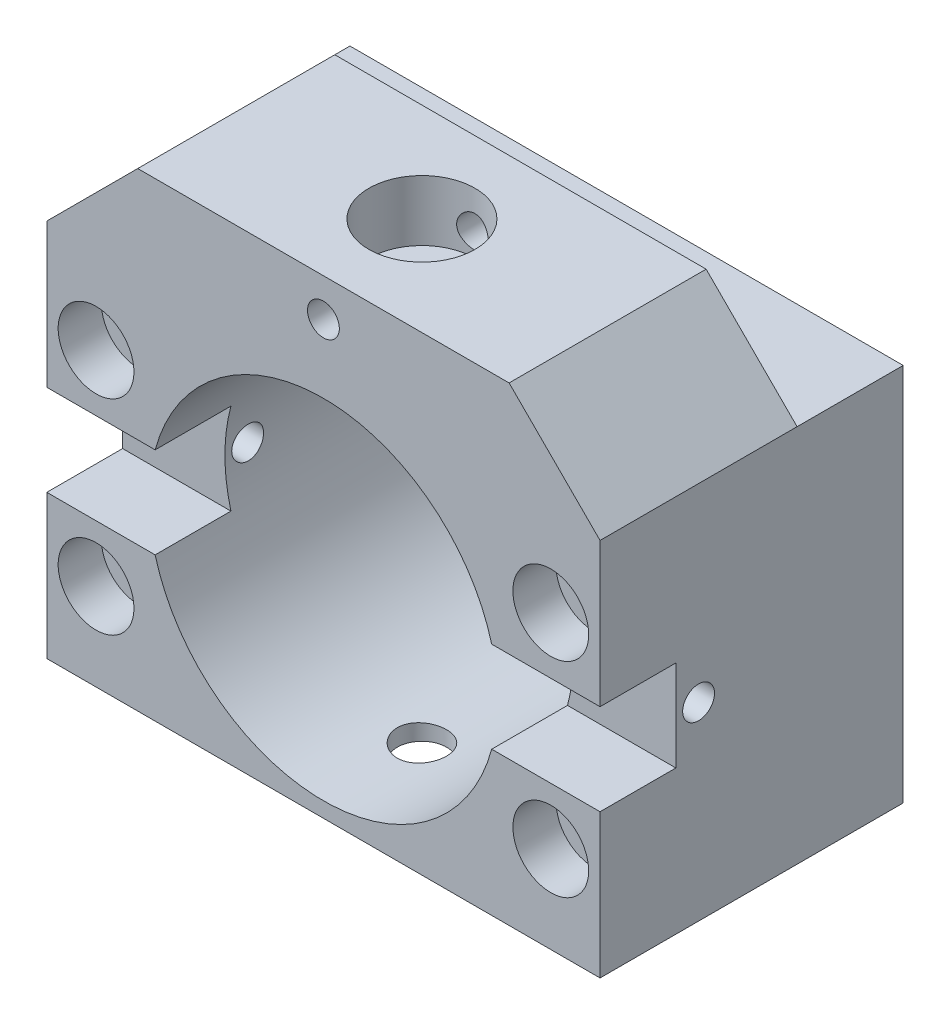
ISO-10303-21;
HEADER;
FILE_DESCRIPTION(('STEP AP214'),'2;1');
FILE_NAME('part.step','',(''),(''),'','','');
FILE_SCHEMA(('AUTOMOTIVE_DESIGN { 1 0 10303 214 1 1 1 1 }'));
ENDSEC;
DATA;
#1=APPLICATION_CONTEXT('core data for automotive mechanical design processes');
#2=APPLICATION_PROTOCOL_DEFINITION('international standard','automotive_design',2000,#1);
#3=PRODUCT_CONTEXT('',#1,'mechanical');
#4=PRODUCT('Part','Part','',(#3));
#5=PRODUCT_RELATED_PRODUCT_CATEGORY('part','',(#4));
#6=PRODUCT_DEFINITION_FORMATION('','',#4);
#7=PRODUCT_DEFINITION_CONTEXT('part definition',#1,'design');
#8=PRODUCT_DEFINITION('design','',#6,#7);
#9=PRODUCT_DEFINITION_SHAPE('','',#8);
#10=(LENGTH_UNIT() NAMED_UNIT(*) SI_UNIT(.MILLI.,.METRE.));
#11=(NAMED_UNIT(*) PLANE_ANGLE_UNIT() SI_UNIT($,.RADIAN.));
#12=(NAMED_UNIT(*) SI_UNIT($,.STERADIAN.) SOLID_ANGLE_UNIT());
#13=UNCERTAINTY_MEASURE_WITH_UNIT(LENGTH_MEASURE(1.E-05),#10,'distance_accuracy_value','');
#14=(GEOMETRIC_REPRESENTATION_CONTEXT(3) GLOBAL_UNCERTAINTY_ASSIGNED_CONTEXT((#13)) GLOBAL_UNIT_ASSIGNED_CONTEXT((#10,
#11,#12)) REPRESENTATION_CONTEXT('',''));
#15=CARTESIAN_POINT('',(0.,0.,0.));
#16=DIRECTION('',(0.,0.,1.));
#17=DIRECTION('',(1.,0.,0.));
#18=AXIS2_PLACEMENT_3D('',#15,#16,#17);
#19=CARTESIAN_POINT('',(0.,23.,27.));
#20=DIRECTION('',(0.,1.,0.));
#21=DIRECTION('',(0.,0.,1.));
#22=AXIS2_PLACEMENT_3D('',#19,#20,#21);
#23=CYLINDRICAL_SURFACE('',#22,7.);
#24=CARTESIAN_POINT('',(0.,28.1,34.));
#25=CARTESIAN_POINT('',(-0.11514137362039,28.0999950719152,33.9999966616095));
#26=CARTESIAN_POINT('',(-0.23034382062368,28.0904935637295,33.9971299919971));
#27=CARTESIAN_POINT('',(-0.457441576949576,28.0528084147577,33.9859652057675));
#28=CARTESIAN_POINT('',(-0.569333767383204,28.0246077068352,33.9776621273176));
#29=CARTESIAN_POINT('',(-0.7864317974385,27.9505526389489,33.9565368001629));
#30=CARTESIAN_POINT('',(-0.891648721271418,27.9047284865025,33.9437222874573));
#31=CARTESIAN_POINT('',(-1.09288836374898,27.7968404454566,33.9149072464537));
#32=CARTESIAN_POINT('',(-1.18891119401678,27.7347767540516,33.8989067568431));
#33=CARTESIAN_POINT('',(-1.37181109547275,27.5942936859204,33.8649120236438));
#34=CARTESIAN_POINT('',(-1.45838787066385,27.5154932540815,33.8468769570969));
#35=CARTESIAN_POINT('',(-1.61733453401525,27.3445647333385,33.8110852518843));
#36=CARTESIAN_POINT('',(-1.68969918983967,27.2524317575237,33.7933287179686));
#37=CARTESIAN_POINT('',(-1.81975218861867,27.0548953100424,33.7596692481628));
#38=CARTESIAN_POINT('',(-1.87706690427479,26.9492364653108,33.7438180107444));
#39=CARTESIAN_POINT('',(-1.97293853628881,26.7292921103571,33.7163995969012));
#40=CARTESIAN_POINT('',(-2.01151810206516,26.6150172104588,33.704827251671));
#41=CARTESIAN_POINT('',(-2.05992056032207,26.4168322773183,33.6900778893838));
#42=CARTESIAN_POINT('',(-2.07492129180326,26.3342608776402,33.6854178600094));
#43=CARTESIAN_POINT('',(-2.09496252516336,26.167803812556,33.679164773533));
#44=CARTESIAN_POINT('',(-2.10000367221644,26.0839182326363,33.6775715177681));
#45=CARTESIAN_POINT('',(-2.09999496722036,25.8849899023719,33.6775783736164));
#46=CARTESIAN_POINT('',(-2.09051437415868,25.7699184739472,33.6805803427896));
#47=CARTESIAN_POINT('',(-2.05291986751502,25.5430933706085,33.6922261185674));
#48=CARTESIAN_POINT('',(-2.02478842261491,25.4313429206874,33.7008752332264));
#49=CARTESIAN_POINT('',(-1.95093565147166,25.2145455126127,33.722746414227));
#50=CARTESIAN_POINT('',(-1.90524767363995,25.1094862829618,33.7359598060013));
#51=CARTESIAN_POINT('',(-1.79768104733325,24.9085150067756,33.7654593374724));
#52=CARTESIAN_POINT('',(-1.73580228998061,24.8126030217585,33.7817454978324));
#53=CARTESIAN_POINT('',(-1.59551383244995,24.6295964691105,33.8161343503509));
#54=CARTESIAN_POINT('',(-1.51668138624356,24.542833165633,33.8342757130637));
#55=CARTESIAN_POINT('',(-1.34560837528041,24.3835212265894,33.8700045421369));
#56=CARTESIAN_POINT('',(-1.25336343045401,24.3109772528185,33.8875918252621));
#57=CARTESIAN_POINT('',(-1.05571078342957,24.18072082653,33.9206731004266));
#58=CARTESIAN_POINT('',(-0.950066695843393,24.1233530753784,33.9361151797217));
#59=CARTESIAN_POINT('',(-0.730152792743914,24.0273791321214,33.9626927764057));
#60=CARTESIAN_POINT('',(-0.615893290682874,23.9887509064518,33.9738333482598));
#61=CARTESIAN_POINT('',(-0.417583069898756,23.9402247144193,33.9880131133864));
#62=CARTESIAN_POINT('',(-0.334860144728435,23.925169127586,33.9924839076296));
#63=CARTESIAN_POINT('',(-0.168102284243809,23.9050552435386,33.9984784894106));
#64=CARTESIAN_POINT('',(-0.0840674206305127,23.8999964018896,34.0000024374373));
#65=CARTESIAN_POINT('',(0.115141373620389,23.9000049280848,33.9999966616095));
#66=CARTESIAN_POINT('',(0.230343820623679,23.9095064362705,33.9971299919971));
#67=CARTESIAN_POINT('',(0.457441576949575,23.9471915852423,33.9859652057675));
#68=CARTESIAN_POINT('',(0.569333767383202,23.9753922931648,33.9776621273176));
#69=CARTESIAN_POINT('',(0.786431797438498,24.0494473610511,33.9565368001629));
#70=CARTESIAN_POINT('',(0.891648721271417,24.0952715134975,33.9437222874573));
#71=CARTESIAN_POINT('',(1.09288836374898,24.2031595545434,33.9149072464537));
#72=CARTESIAN_POINT('',(1.18891119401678,24.2652232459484,33.8989067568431));
#73=CARTESIAN_POINT('',(1.37181109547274,24.4057063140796,33.8649120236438));
#74=CARTESIAN_POINT('',(1.45838787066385,24.4845067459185,33.8468769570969));
#75=CARTESIAN_POINT('',(1.61733453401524,24.6554352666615,33.8110852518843));
#76=CARTESIAN_POINT('',(1.68969918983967,24.7475682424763,33.7933287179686));
#77=CARTESIAN_POINT('',(1.81975218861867,24.9451046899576,33.7596692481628));
#78=CARTESIAN_POINT('',(1.87706690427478,25.0507635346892,33.7438180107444));
#79=CARTESIAN_POINT('',(1.97293853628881,25.2707078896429,33.7163995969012));
#80=CARTESIAN_POINT('',(2.01151810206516,25.3849827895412,33.704827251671));
#81=CARTESIAN_POINT('',(2.05992056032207,25.5831677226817,33.6900778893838));
#82=CARTESIAN_POINT('',(2.07492129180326,25.6657391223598,33.6854178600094));
#83=CARTESIAN_POINT('',(2.09496252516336,25.832196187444,33.679164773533));
#84=CARTESIAN_POINT('',(2.10000367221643,25.9160817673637,33.6775715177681));
#85=CARTESIAN_POINT('',(2.09999496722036,26.115010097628,33.6775783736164));
#86=CARTESIAN_POINT('',(2.09051437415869,26.2300815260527,33.6805803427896));
#87=CARTESIAN_POINT('',(2.05291986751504,26.4569066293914,33.6922261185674));
#88=CARTESIAN_POINT('',(2.02478842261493,26.5686570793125,33.7008752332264));
#89=CARTESIAN_POINT('',(1.95093565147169,26.7854544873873,33.722746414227));
#90=CARTESIAN_POINT('',(1.90524767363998,26.8905137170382,33.7359598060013));
#91=CARTESIAN_POINT('',(1.7976810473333,27.0914849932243,33.7654593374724));
#92=CARTESIAN_POINT('',(1.73580228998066,27.1873969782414,33.7817454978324));
#93=CARTESIAN_POINT('',(1.59551383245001,27.3704035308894,33.8161343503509));
#94=CARTESIAN_POINT('',(1.51668138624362,27.4571668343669,33.8342757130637));
#95=CARTESIAN_POINT('',(1.34560837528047,27.6164787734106,33.8700045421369));
#96=CARTESIAN_POINT('',(1.25336343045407,27.6890227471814,33.8875918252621));
#97=CARTESIAN_POINT('',(1.05571078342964,27.8192791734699,33.9206731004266));
#98=CARTESIAN_POINT('',(0.950066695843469,27.8766469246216,33.9361151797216));
#99=CARTESIAN_POINT('',(0.730152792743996,27.9726208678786,33.9626927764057));
#100=CARTESIAN_POINT('',(0.615893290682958,28.0112490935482,33.9738333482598));
#101=CARTESIAN_POINT('',(0.417583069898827,28.0597752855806,33.9880131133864));
#102=CARTESIAN_POINT('',(0.334860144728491,28.074830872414,33.9924839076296));
#103=CARTESIAN_POINT('',(0.168102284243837,28.0949447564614,33.9984784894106));
#104=CARTESIAN_POINT('',(0.0840674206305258,28.1000035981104,34.0000024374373));
#105=CARTESIAN_POINT('',(0.,28.1,34.));
#106=B_SPLINE_CURVE_WITH_KNOTS('',3,(#24,#25,#26,#27,#28,#29,#30,#31,#32,#33,#34,#35,#36,#37,
#38,#39,#40,#41,#42,#43,#44,#45,#46,#47,#48,#49,#50,#51,#52,#53,#54,#55,#56,#57,#58,#59,#60,#61,
#62,#63,#64,#65,#66,#67,#68,#69,#70,#71,#72,#73,#74,#75,#76,#77,#78,#79,#80,#81,#82,#83,#84,#85,
#86,#87,#88,#89,#90,#91,#92,#93,#94,#95,#96,#97,#98,#99,#100,#101,#102,#103,#104,#105),
.UNSPECIFIED.,.T.,.F.,(4,2,2,2,2,2,2,2,2,2,2,2,2,2,2,2,2,2,2,2,2,2,2,2,2,2,2,2,2,2,2,2,2,2,2,2,
2,2,2,2,4),(0.,0.345110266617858,0.69053595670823,1.0353721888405,1.38020423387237,
1.73394318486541,2.087812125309,2.44977661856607,2.81130242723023,3.06284380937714,
3.31436889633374,3.65908450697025,4.00412460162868,4.34851251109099,4.69290273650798,
5.04715777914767,5.40152877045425,5.76336627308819,6.12477729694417,6.37676413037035,
6.62873723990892,6.97384750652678,7.31927319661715,7.66410942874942,8.00894147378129,
8.36268042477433,8.71654936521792,9.07851385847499,9.44003966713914,9.69158104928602,
9.94310613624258,10.2878217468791,10.6328618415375,10.9772497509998,11.3216399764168,
11.6758950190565,12.0302660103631,12.392103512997,12.753514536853,13.0055013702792,
13.2574744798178),.UNSPECIFIED.);
#107=CARTESIAN_POINT('',(0.,28.1,34.));
#108=VERTEX_POINT('',#107);
#109=EDGE_CURVE('E422',#108,#108,#106,.T.);
#110=ORIENTED_EDGE('',*,*,#109,.T.);
#111=EDGE_LOOP('',(#110));
#112=FACE_BOUND('',#111,.T.);
#113=CARTESIAN_POINT('',(0.,31.,27.));
#114=DIRECTION('',(0.,1.,0.));
#115=DIRECTION('',(0.,0.,1.));
#116=AXIS2_PLACEMENT_3D('',#113,#114,#115);
#117=CIRCLE('',#116,7.);
#118=CARTESIAN_POINT('',(0.,31.,34.));
#119=VERTEX_POINT('',#118);
#120=EDGE_CURVE('E429',#119,#119,#117,.T.);
#121=ORIENTED_EDGE('',*,*,#120,.T.);
#122=EDGE_LOOP('',(#121));
#123=FACE_BOUND('',#122,.T.);
#124=CARTESIAN_POINT('',(2.09999999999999,26.,20.3224255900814));
#125=CARTESIAN_POINT('',(2.09999496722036,25.884989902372,20.3224216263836));
#126=CARTESIAN_POINT('',(2.09051437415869,25.7699184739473,20.3194196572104));
#127=CARTESIAN_POINT('',(2.05291986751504,25.5430933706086,20.3077738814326));
#128=CARTESIAN_POINT('',(2.02478842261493,25.4313429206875,20.2991247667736));
#129=CARTESIAN_POINT('',(1.95093565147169,25.2145455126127,20.277253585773));
#130=CARTESIAN_POINT('',(1.90524767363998,25.1094862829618,20.2640401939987));
#131=CARTESIAN_POINT('',(1.7976810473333,24.9085150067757,20.2345406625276));
#132=CARTESIAN_POINT('',(1.73580228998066,24.8126030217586,20.2182545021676));
#133=CARTESIAN_POINT('',(1.59551383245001,24.6295964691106,20.1838656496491));
#134=CARTESIAN_POINT('',(1.51668138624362,24.5428331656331,20.1657242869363));
#135=CARTESIAN_POINT('',(1.34560837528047,24.3835212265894,20.1299954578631));
#136=CARTESIAN_POINT('',(1.25336343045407,24.3109772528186,20.1124081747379));
#137=CARTESIAN_POINT('',(1.05571078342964,24.1807208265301,20.0793268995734));
#138=CARTESIAN_POINT('',(0.950066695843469,24.1233530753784,20.0638848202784));
#139=CARTESIAN_POINT('',(0.730152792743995,24.0273791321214,20.0373072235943));
#140=CARTESIAN_POINT('',(0.615893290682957,23.9887509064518,20.0261666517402));
#141=CARTESIAN_POINT('',(0.417583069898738,23.9402247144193,20.0119868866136));
#142=CARTESIAN_POINT('',(0.334860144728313,23.925169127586,20.0075160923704));
#143=CARTESIAN_POINT('',(0.168102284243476,23.9050552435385,20.0015215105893));
#144=CARTESIAN_POINT('',(0.0840674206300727,23.8999964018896,19.9999975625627));
#145=CARTESIAN_POINT('',(-0.115141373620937,23.9000049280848,20.0000033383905));
#146=CARTESIAN_POINT('',(-0.230343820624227,23.9095064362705,20.002870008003));
#147=CARTESIAN_POINT('',(-0.457441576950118,23.9471915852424,20.0140347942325));
#148=CARTESIAN_POINT('',(-0.56933376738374,23.9753922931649,20.0223378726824));
#149=CARTESIAN_POINT('',(-0.786431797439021,24.0494473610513,20.0434631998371));
#150=CARTESIAN_POINT('',(-0.891648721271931,24.0952715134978,20.0562777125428));
#151=CARTESIAN_POINT('',(-1.09288836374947,24.2031595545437,20.0850927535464));
#152=CARTESIAN_POINT('',(-1.18891119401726,24.2652232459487,20.101093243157));
#153=CARTESIAN_POINT('',(-1.37181109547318,24.40570631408,20.1350879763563));
#154=CARTESIAN_POINT('',(-1.45838787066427,24.4845067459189,20.1531230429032));
#155=CARTESIAN_POINT('',(-1.61733453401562,24.6554352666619,20.1889147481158));
#156=CARTESIAN_POINT('',(-1.68969918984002,24.7475682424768,20.2066712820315));
#157=CARTESIAN_POINT('',(-1.81975218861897,24.9451046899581,20.2403307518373));
#158=CARTESIAN_POINT('',(-1.87706690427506,25.0507635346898,20.2561819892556));
#159=CARTESIAN_POINT('',(-1.97293853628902,25.2707078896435,20.2836004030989));
#160=CARTESIAN_POINT('',(-2.01151810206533,25.3849827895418,20.295172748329));
#161=CARTESIAN_POINT('',(-2.05992056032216,25.5831677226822,20.3099221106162));
#162=CARTESIAN_POINT('',(-2.07492129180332,25.6657391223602,20.3145821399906));
#163=CARTESIAN_POINT('',(-2.09496252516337,25.8321961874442,20.320835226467));
#164=CARTESIAN_POINT('',(-2.10000367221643,25.9160817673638,20.3224284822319));
#165=CARTESIAN_POINT('',(-2.09999496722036,26.115010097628,20.3224216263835));
#166=CARTESIAN_POINT('',(-2.09051437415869,26.2300815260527,20.3194196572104));
#167=CARTESIAN_POINT('',(-2.05291986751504,26.4569066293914,20.3077738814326));
#168=CARTESIAN_POINT('',(-2.02478842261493,26.5686570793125,20.2991247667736));
#169=CARTESIAN_POINT('',(-1.95093565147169,26.7854544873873,20.277253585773));
#170=CARTESIAN_POINT('',(-1.90524767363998,26.8905137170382,20.2640401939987));
#171=CARTESIAN_POINT('',(-1.7976810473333,27.0914849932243,20.2345406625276));
#172=CARTESIAN_POINT('',(-1.73580228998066,27.1873969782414,20.2182545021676));
#173=CARTESIAN_POINT('',(-1.59551383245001,27.3704035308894,20.1838656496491));
#174=CARTESIAN_POINT('',(-1.51668138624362,27.4571668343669,20.1657242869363));
#175=CARTESIAN_POINT('',(-1.34560837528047,27.6164787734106,20.1299954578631));
#176=CARTESIAN_POINT('',(-1.25336343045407,27.6890227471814,20.1124081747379));
#177=CARTESIAN_POINT('',(-1.05571078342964,27.8192791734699,20.0793268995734));
#178=CARTESIAN_POINT('',(-0.950066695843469,27.8766469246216,20.0638848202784));
#179=CARTESIAN_POINT('',(-0.730152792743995,27.9726208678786,20.0373072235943));
#180=CARTESIAN_POINT('',(-0.615893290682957,28.0112490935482,20.0261666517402));
#181=CARTESIAN_POINT('',(-0.417583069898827,28.0597752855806,20.0119868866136));
#182=CARTESIAN_POINT('',(-0.334860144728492,28.074830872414,20.0075160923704));
#183=CARTESIAN_POINT('',(-0.168102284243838,28.0949447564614,20.0015215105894));
#184=CARTESIAN_POINT('',(-0.0840674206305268,28.1000035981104,19.9999975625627));
#185=CARTESIAN_POINT('',(0.115141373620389,28.0999950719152,20.0000033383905));
#186=CARTESIAN_POINT('',(0.230343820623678,28.0904935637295,20.0028700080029));
#187=CARTESIAN_POINT('',(0.457441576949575,28.0528084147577,20.0140347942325));
#188=CARTESIAN_POINT('',(0.569333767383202,28.0246077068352,20.0223378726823));
#189=CARTESIAN_POINT('',(0.786431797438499,27.9505526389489,20.0434631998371));
#190=CARTESIAN_POINT('',(0.891648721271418,27.9047284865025,20.0562777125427));
#191=CARTESIAN_POINT('',(1.09288836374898,27.7968404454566,20.0850927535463));
#192=CARTESIAN_POINT('',(1.18891119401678,27.7347767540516,20.1010932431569));
#193=CARTESIAN_POINT('',(1.37181109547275,27.5942936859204,20.1350879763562));
#194=CARTESIAN_POINT('',(1.45838787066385,27.5154932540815,20.1531230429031));
#195=CARTESIAN_POINT('',(1.61733453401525,27.3445647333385,20.1889147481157));
#196=CARTESIAN_POINT('',(1.68969918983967,27.2524317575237,20.2066712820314));
#197=CARTESIAN_POINT('',(1.81975218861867,27.0548953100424,20.2403307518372));
#198=CARTESIAN_POINT('',(1.87706690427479,26.9492364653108,20.2561819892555));
#199=CARTESIAN_POINT('',(1.97293853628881,26.7292921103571,20.2836004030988));
#200=CARTESIAN_POINT('',(2.01151810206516,26.6150172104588,20.295172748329));
#201=CARTESIAN_POINT('',(2.05992056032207,26.4168322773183,20.3099221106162));
#202=CARTESIAN_POINT('',(2.07492129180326,26.3342608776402,20.3145821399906));
#203=CARTESIAN_POINT('',(2.09496252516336,26.167803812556,20.320835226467));
#204=CARTESIAN_POINT('',(2.10000367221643,26.0839182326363,20.3224284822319));
#205=CARTESIAN_POINT('',(2.09999999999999,26.,20.3224255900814));
#206=B_SPLINE_CURVE_WITH_KNOTS('',3,(#124,#125,#126,#127,#128,#129,#130,#131,#132,#133,#134,
#135,#136,#137,#138,#139,#140,#141,#142,#143,#144,#145,#146,#147,#148,#149,#150,#151,#152,#153,
#154,#155,#156,#157,#158,#159,#160,#161,#162,#163,#164,#165,#166,#167,#168,#169,#170,#171,#172,
#173,#174,#175,#176,#177,#178,#179,#180,#181,#182,#183,#184,#185,#186,#187,#188,#189,#190,#191,
#192,#193,#194,#195,#196,#197,#198,#199,#200,#201,#202,#203,#204,#205),.UNSPECIFIED.,.T.,.F.,(4,
2,2,2,2,2,2,2,2,2,2,2,2,2,2,2,2,2,2,2,2,2,2,2,2,2,2,2,2,2,2,2,2,2,2,2,2,2,2,2,4),(0.,
0.344715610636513,0.689755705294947,1.03414361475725,1.37853384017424,1.73278888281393,
2.08715987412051,2.44899737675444,2.81040840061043,3.06239523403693,3.31436834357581,
3.65947861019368,4.00490430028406,4.34974053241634,4.69457257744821,5.04831152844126,
5.40218046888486,5.76414496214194,6.12567077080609,6.37721215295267,6.62873723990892,
6.97345285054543,7.31849294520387,7.66288085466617,8.00727108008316,8.36152612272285,
8.71589711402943,9.07773461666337,9.43914564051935,9.69113247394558,9.94310558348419,
10.288215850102,10.6336415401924,10.9784777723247,11.3233098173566,11.6770487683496,
12.0309177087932,12.3928822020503,12.7544080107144,13.0059493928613,13.2574744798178),.UNSPECIFIED.);
#207=CARTESIAN_POINT('',(2.09999999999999,26.,20.3224255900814));
#208=VERTEX_POINT('',#207);
#209=EDGE_CURVE('E432',#208,#208,#206,.T.);
#210=ORIENTED_EDGE('',*,*,#209,.T.);
#211=EDGE_LOOP('',(#210));
#212=FACE_BOUND('',#211,.T.);
#213=CARTESIAN_POINT('',(0.,23.,27.));
#214=DIRECTION('',(0.,1.,0.));
#215=DIRECTION('',(0.,0.,1.));
#216=AXIS2_PLACEMENT_3D('',#213,#214,#215);
#217=CIRCLE('',#216,7.);
#218=CARTESIAN_POINT('',(0.,23.,34.));
#219=VERTEX_POINT('',#218);
#220=EDGE_CURVE('E21',#219,#219,#217,.T.);
#221=ORIENTED_EDGE('',*,*,#220,.F.);
#222=EDGE_LOOP('',(#221));
#223=FACE_BOUND('',#222,.T.);
#224=ADVANCED_FACE('F17',(#112,#123,#212,#223),#23,.F.);
#225=CARTESIAN_POINT('',(0.,23.,27.));
#226=DIRECTION('',(0.,1.,0.));
#227=DIRECTION('',(0.,0.,1.));
#228=AXIS2_PLACEMENT_3D('',#225,#226,#227);
#229=PLANE('',#228);
#230=ORIENTED_EDGE('',*,*,#220,.T.);
#231=EDGE_LOOP('',(#230));
#232=FACE_BOUND('',#231,.T.);
#233=CARTESIAN_POINT('',(0.,23.,27.));
#234=DIRECTION('',(0.,1.,0.));
#235=DIRECTION('',(0.,0.,1.));
#236=AXIS2_PLACEMENT_3D('',#233,#234,#235);
#237=CIRCLE('',#236,3.25);
#238=CARTESIAN_POINT('',(0.,23.,30.25));
#239=VERTEX_POINT('',#238);
#240=EDGE_CURVE('E228',#239,#239,#237,.F.);
#241=ORIENTED_EDGE('',*,*,#240,.T.);
#242=EDGE_LOOP('',(#241));
#243=FACE_BOUND('',#242,.T.);
#244=ADVANCED_FACE('F442',(#232,#243),#229,.T.);
#245=CARTESIAN_POINT('',(0.,26.,40.));
#246=DIRECTION('',(0.,0.,1.));
#247=DIRECTION('',(1.,0.,0.));
#248=AXIS2_PLACEMENT_3D('',#245,#246,#247);
#249=CYLINDRICAL_SURFACE('',#248,2.09999999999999);
#250=ORIENTED_EDGE('',*,*,#209,.F.);
#251=EDGE_LOOP('',(#250));
#252=FACE_BOUND('',#251,.T.);
#253=CARTESIAN_POINT('',(0.,26.,14.));
#254=DIRECTION('',(0.,0.,1.));
#255=DIRECTION('',(1.,0.,0.));
#256=AXIS2_PLACEMENT_3D('',#253,#254,#255);
#257=CIRCLE('',#256,2.09999999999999);
#258=CARTESIAN_POINT('',(2.09999999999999,26.,14.));
#259=VERTEX_POINT('',#258);
#260=EDGE_CURVE('E207',#259,#259,#257,.F.);
#261=ORIENTED_EDGE('',*,*,#260,.T.);
#262=EDGE_LOOP('',(#261));
#263=FACE_BOUND('',#262,.T.);
#264=ADVANCED_FACE('F437',(#252,#263),#249,.F.);
#265=CARTESIAN_POINT('',(-36.5,31.,40.));
#266=DIRECTION('',(0.,-1.,0.));
#267=DIRECTION('',(0.,0.,-1.));
#268=AXIS2_PLACEMENT_3D('',#265,#266,#267);
#269=PLANE('',#268);
#270=DIRECTION('',(1.,0.,0.));
#271=VECTOR('',#270,1.);
#272=CARTESIAN_POINT('',(36.5,31.,14.));
#273=LINE('',#272,#271);
#274=CARTESIAN_POINT('',(24.5,31.,14.));
#275=VERTEX_POINT('',#274);
#276=CARTESIAN_POINT('',(-24.5,31.,14.));
#277=VERTEX_POINT('',#276);
#278=EDGE_CURVE('E225',#275,#277,#273,.F.);
#279=ORIENTED_EDGE('',*,*,#278,.T.);
#280=DIRECTION('',(0.,0.,1.));
#281=VECTOR('',#280,1.);
#282=CARTESIAN_POINT('',(-24.5,31.,40.));
#283=LINE('',#282,#281);
#284=CARTESIAN_POINT('',(-24.5,31.,40.));
#285=VERTEX_POINT('',#284);
#286=EDGE_CURVE('E204',#277,#285,#283,.T.);
#287=ORIENTED_EDGE('',*,*,#286,.T.);
#288=DIRECTION('',(1.,0.,0.));
#289=VECTOR('',#288,1.);
#290=CARTESIAN_POINT('',(0.,31.,40.));
#291=LINE('',#290,#289);
#292=CARTESIAN_POINT('',(24.5,31.,40.));
#293=VERTEX_POINT('',#292);
#294=EDGE_CURVE('E544',#293,#285,#291,.F.);
#295=ORIENTED_EDGE('',*,*,#294,.F.);
#296=DIRECTION('',(0.,0.,1.));
#297=VECTOR('',#296,1.);
#298=CARTESIAN_POINT('',(24.5,31.,40.));
#299=LINE('',#298,#297);
#300=EDGE_CURVE('E170',#293,#275,#299,.F.);
#301=ORIENTED_EDGE('',*,*,#300,.T.);
#302=EDGE_LOOP('',(#279,#287,#295,#301));
#303=FACE_BOUND('',#302,.T.);
#304=ORIENTED_EDGE('',*,*,#120,.F.);
#305=EDGE_LOOP('',(#304));
#306=FACE_BOUND('',#305,.T.);
#307=ADVANCED_FACE('F441',(#303,#306),#269,.F.);
#308=CARTESIAN_POINT('',(30.,7.5,40.));
#309=DIRECTION('',(0.,0.,1.));
#310=DIRECTION('',(1.,0.,0.));
#311=AXIS2_PLACEMENT_3D('',#308,#309,#310);
#312=CYLINDRICAL_SURFACE('',#311,5.);
#313=CARTESIAN_POINT('',(30.,7.5,40.));
#314=DIRECTION('',(0.,0.,1.));
#315=DIRECTION('',(1.,0.,0.));
#316=AXIS2_PLACEMENT_3D('',#313,#314,#315);
#317=CIRCLE('',#316,5.);
#318=CARTESIAN_POINT('',(35.,7.5,40.));
#319=VERTEX_POINT('',#318);
#320=EDGE_CURVE('E467',#319,#319,#317,.F.);
#321=ORIENTED_EDGE('',*,*,#320,.F.);
#322=EDGE_LOOP('',(#321));
#323=FACE_BOUND('',#322,.T.);
#324=CARTESIAN_POINT('',(30.,7.5,34.3));
#325=DIRECTION('',(0.,0.,1.));
#326=DIRECTION('',(1.,0.,0.));
#327=AXIS2_PLACEMENT_3D('',#324,#325,#326);
#328=CIRCLE('',#327,5.);
#329=CARTESIAN_POINT('',(35.,7.5,34.3));
#330=VERTEX_POINT('',#329);
#331=EDGE_CURVE('E456',#330,#330,#328,.F.);
#332=ORIENTED_EDGE('',*,*,#331,.T.);
#333=EDGE_LOOP('',(#332));
#334=FACE_BOUND('',#333,.T.);
#335=ADVANCED_FACE('F737',(#323,#334),#312,.F.);
#336=CARTESIAN_POINT('',(-30.,7.5,40.));
#337=DIRECTION('',(0.,0.,1.));
#338=DIRECTION('',(1.,0.,0.));
#339=AXIS2_PLACEMENT_3D('',#336,#337,#338);
#340=CYLINDRICAL_SURFACE('',#339,5.);
#341=CARTESIAN_POINT('',(-30.,7.5,40.));
#342=DIRECTION('',(0.,0.,1.));
#343=DIRECTION('',(1.,0.,0.));
#344=AXIS2_PLACEMENT_3D('',#341,#342,#343);
#345=CIRCLE('',#344,5.);
#346=CARTESIAN_POINT('',(-25.,7.5,40.));
#347=VERTEX_POINT('',#346);
#348=EDGE_CURVE('E470',#347,#347,#345,.F.);
#349=ORIENTED_EDGE('',*,*,#348,.F.);
#350=EDGE_LOOP('',(#349));
#351=FACE_BOUND('',#350,.T.);
#352=CARTESIAN_POINT('',(-30.,7.5,34.3));
#353=DIRECTION('',(0.,0.,1.));
#354=DIRECTION('',(1.,0.,0.));
#355=AXIS2_PLACEMENT_3D('',#352,#353,#354);
#356=CIRCLE('',#355,5.);
#357=CARTESIAN_POINT('',(-25.,7.5,34.3));
#358=VERTEX_POINT('',#357);
#359=EDGE_CURVE('E428',#358,#358,#356,.F.);
#360=ORIENTED_EDGE('',*,*,#359,.T.);
#361=EDGE_LOOP('',(#360));
#362=FACE_BOUND('',#361,.T.);
#363=ADVANCED_FACE('F418',(#351,#362),#340,.F.);
#364=CARTESIAN_POINT('',(0.,26.,40.));
#365=DIRECTION('',(0.,0.,1.));
#366=DIRECTION('',(1.,0.,0.));
#367=AXIS2_PLACEMENT_3D('',#364,#365,#366);
#368=CYLINDRICAL_SURFACE('',#367,2.09999999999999);
#369=CARTESIAN_POINT('',(0.,26.,40.));
#370=DIRECTION('',(0.,0.,1.));
#371=DIRECTION('',(1.,0.,0.));
#372=AXIS2_PLACEMENT_3D('',#369,#370,#371);
#373=CIRCLE('',#372,2.09999999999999);
#374=CARTESIAN_POINT('',(2.09999999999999,26.,40.));
#375=VERTEX_POINT('',#374);
#376=EDGE_CURVE('E474',#375,#375,#373,.F.);
#377=ORIENTED_EDGE('',*,*,#376,.F.);
#378=EDGE_LOOP('',(#377));
#379=FACE_BOUND('',#378,.T.);
#380=ORIENTED_EDGE('',*,*,#109,.F.);
#381=EDGE_LOOP('',(#380));
#382=FACE_BOUND('',#381,.T.);
#383=ADVANCED_FACE('F413',(#379,#382),#368,.F.);
#384=CARTESIAN_POINT('',(-27.35,7.5,34.3));
#385=DIRECTION('',(0.,0.,-1.));
#386=DIRECTION('',(-1.,0.,0.));
#387=AXIS2_PLACEMENT_3D('',#384,#385,#386);
#388=PLANE('',#387);
#389=ORIENTED_EDGE('',*,*,#359,.F.);
#390=EDGE_LOOP('',(#389));
#391=FACE_BOUND('',#390,.T.);
#392=CARTESIAN_POINT('',(-30.,7.5,34.3));
#393=DIRECTION('',(0.,0.,1.));
#394=DIRECTION('',(1.,0.,0.));
#395=AXIS2_PLACEMENT_3D('',#392,#393,#394);
#396=CIRCLE('',#395,2.64999999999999);
#397=CARTESIAN_POINT('',(-27.35,7.5,34.3));
#398=VERTEX_POINT('',#397);
#399=EDGE_CURVE('E477',#398,#398,#396,.F.);
#400=ORIENTED_EDGE('',*,*,#399,.T.);
#401=EDGE_LOOP('',(#400));
#402=FACE_BOUND('',#401,.T.);
#403=ADVANCED_FACE('F409',(#391,#402),#388,.F.);
#404=CARTESIAN_POINT('',(32.65,7.5,34.3));
#405=DIRECTION('',(0.,0.,-1.));
#406=DIRECTION('',(-1.,0.,0.));
#407=AXIS2_PLACEMENT_3D('',#404,#405,#406);
#408=PLANE('',#407);
#409=ORIENTED_EDGE('',*,*,#331,.F.);
#410=EDGE_LOOP('',(#409));
#411=FACE_BOUND('',#410,.T.);
#412=CARTESIAN_POINT('',(30.,7.5,34.3));
#413=DIRECTION('',(0.,0.,1.));
#414=DIRECTION('',(1.,0.,0.));
#415=AXIS2_PLACEMENT_3D('',#412,#413,#414);
#416=CIRCLE('',#415,2.65);
#417=CARTESIAN_POINT('',(32.65,7.5,34.3));
#418=VERTEX_POINT('',#417);
#419=EDGE_CURVE('E480',#418,#418,#416,.F.);
#420=ORIENTED_EDGE('',*,*,#419,.T.);
#421=EDGE_LOOP('',(#420));
#422=FACE_BOUND('',#421,.T.);
#423=ADVANCED_FACE('F405',(#411,#422),#408,.F.);
#424=CARTESIAN_POINT('',(32.65,-19.5,34.3));
#425=DIRECTION('',(0.,0.,-1.));
#426=DIRECTION('',(-1.,0.,0.));
#427=AXIS2_PLACEMENT_3D('',#424,#425,#426);
#428=PLANE('',#427);
#429=CARTESIAN_POINT('',(30.,-19.5,34.3));
#430=DIRECTION('',(0.,0.,1.));
#431=DIRECTION('',(1.,0.,0.));
#432=AXIS2_PLACEMENT_3D('',#429,#430,#431);
#433=CIRCLE('',#432,5.);
#434=CARTESIAN_POINT('',(35.,-19.5,34.3));
#435=VERTEX_POINT('',#434);
#436=EDGE_CURVE('E209',#435,#435,#433,.T.);
#437=ORIENTED_EDGE('',*,*,#436,.T.);
#438=EDGE_LOOP('',(#437));
#439=FACE_BOUND('',#438,.T.);
#440=CARTESIAN_POINT('',(30.,-19.5,34.3));
#441=DIRECTION('',(0.,0.,1.));
#442=DIRECTION('',(1.,0.,0.));
#443=AXIS2_PLACEMENT_3D('',#440,#441,#442);
#444=CIRCLE('',#443,2.65);
#445=CARTESIAN_POINT('',(32.65,-19.5,34.3));
#446=VERTEX_POINT('',#445);
#447=EDGE_CURVE('E167',#446,#446,#444,.F.);
#448=ORIENTED_EDGE('',*,*,#447,.T.);
#449=EDGE_LOOP('',(#448));
#450=FACE_BOUND('',#449,.T.);
#451=ADVANCED_FACE('F401',(#439,#450),#428,.F.);
#452=CARTESIAN_POINT('',(-27.35,-19.5,34.3));
#453=DIRECTION('',(0.,0.,-1.));
#454=DIRECTION('',(-1.,0.,0.));
#455=AXIS2_PLACEMENT_3D('',#452,#453,#454);
#456=PLANE('',#455);
#457=CARTESIAN_POINT('',(-30.,-19.5,34.3));
#458=DIRECTION('',(0.,0.,1.));
#459=DIRECTION('',(1.,0.,0.));
#460=AXIS2_PLACEMENT_3D('',#457,#458,#459);
#461=CIRCLE('',#460,5.);
#462=CARTESIAN_POINT('',(-25.,-19.5,34.3));
#463=VERTEX_POINT('',#462);
#464=EDGE_CURVE('E464',#463,#463,#461,.T.);
#465=ORIENTED_EDGE('',*,*,#464,.T.);
#466=EDGE_LOOP('',(#465));
#467=FACE_BOUND('',#466,.T.);
#468=CARTESIAN_POINT('',(-30.,-19.5,34.3));
#469=DIRECTION('',(0.,0.,1.));
#470=DIRECTION('',(1.,0.,0.));
#471=AXIS2_PLACEMENT_3D('',#468,#469,#470);
#472=CIRCLE('',#471,2.64999999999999);
#473=CARTESIAN_POINT('',(-27.35,-19.5,34.3));
#474=VERTEX_POINT('',#473);
#475=EDGE_CURVE('E161',#474,#474,#472,.F.);
#476=ORIENTED_EDGE('',*,*,#475,.T.);
#477=EDGE_LOOP('',(#476));
#478=FACE_BOUND('',#477,.T.);
#479=ADVANCED_FACE('F397',(#467,#478),#456,.F.);
#480=CARTESIAN_POINT('',(0.,-31.,27.));
#481=DIRECTION('',(0.,1.,0.));
#482=DIRECTION('',(0.,0.,1.));
#483=AXIS2_PLACEMENT_3D('',#480,#481,#482);
#484=CYLINDRICAL_SURFACE('',#483,3.25);
#485=CARTESIAN_POINT('',(0.,17.,23.75));
#486=CARTESIAN_POINT('',(0.181413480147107,16.9999971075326,23.7500081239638));
#487=CARTESIAN_POINT('',(0.363062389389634,16.9978293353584,23.7652532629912));
#488=CARTESIAN_POINT('',(0.721421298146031,16.9893851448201,23.8258548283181));
#489=CARTESIAN_POINT('',(0.898120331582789,16.9831002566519,23.8712733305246));
#490=CARTESIAN_POINT('',(1.24114748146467,16.9671286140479,23.9908497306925));
#491=CARTESIAN_POINT('',(1.40748709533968,16.9574457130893,24.0649750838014));
#492=CARTESIAN_POINT('',(1.72529226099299,16.9357530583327,24.239790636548));
#493=CARTESIAN_POINT('',(1.87676373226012,16.9237442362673,24.3404702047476));
#494=CARTESIAN_POINT('',(2.16168411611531,16.8986404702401,24.5663048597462));
#495=CARTESIAN_POINT('',(2.29501296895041,16.885539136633,24.691610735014));
#496=CARTESIAN_POINT('',(2.53883105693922,16.8597770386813,24.9628223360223));
#497=CARTESIAN_POINT('',(2.64931788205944,16.8471163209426,25.1087302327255));
#498=CARTESIAN_POINT('',(2.8447585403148,16.8236087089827,25.4177809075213));
#499=CARTESIAN_POINT('',(2.92959983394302,16.8127698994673,25.5809955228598));
#500=CARTESIAN_POINT('',(3.07062101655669,16.7942180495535,25.9195345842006));
#501=CARTESIAN_POINT('',(3.12680254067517,16.7865048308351,26.094858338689));
#502=CARTESIAN_POINT('',(3.20854638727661,16.7751386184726,26.4514032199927));
#503=CARTESIAN_POINT('',(3.23431002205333,16.7714589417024,26.6325773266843));
#504=CARTESIAN_POINT('',(3.25511011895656,16.7684952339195,26.9967122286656));
#505=CARTESIAN_POINT('',(3.25014809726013,16.7692109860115,27.1796729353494));
#506=CARTESIAN_POINT('',(3.20980260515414,16.7749328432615,27.5407704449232));
#507=CARTESIAN_POINT('',(3.17464270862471,16.7799074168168,27.7189327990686));
#508=CARTESIAN_POINT('',(3.07524855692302,16.7935372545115,28.0668049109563));
#509=CARTESIAN_POINT('',(3.01101331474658,16.8021926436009,28.2365143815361));
#510=CARTESIAN_POINT('',(2.85505402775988,16.8222443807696,28.5633524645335));
#511=CARTESIAN_POINT('',(2.76323347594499,16.8336503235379,28.7204344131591));
#512=CARTESIAN_POINT('',(2.55478668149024,16.8579097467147,29.0170328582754));
#513=CARTESIAN_POINT('',(2.43816096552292,16.8707631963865,29.1565497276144));
#514=CARTESIAN_POINT('',(2.18220611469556,16.8966073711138,29.4153438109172));
#515=CARTESIAN_POINT('',(2.04268881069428,16.9095983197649,29.534434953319));
#516=CARTESIAN_POINT('',(1.74547301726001,16.9341562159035,29.7475940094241));
#517=CARTESIAN_POINT('',(1.58776632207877,16.9457225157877,29.8416505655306));
#518=CARTESIAN_POINT('',(1.25845233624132,16.9661391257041,30.002067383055));
#519=CARTESIAN_POINT('',(1.08682724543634,16.9749858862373,30.068391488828));
#520=CARTESIAN_POINT('',(0.734952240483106,16.9889251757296,30.171089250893));
#521=CARTESIAN_POINT('',(0.554721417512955,16.9940256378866,30.2075262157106));
#522=CARTESIAN_POINT('',(0.311025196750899,16.9979812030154,30.2356859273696));
#523=CARTESIAN_POINT('',(0.24895151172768,16.9987366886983,30.2410495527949));
#524=CARTESIAN_POINT('',(0.124594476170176,16.9997465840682,30.2482079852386));
#525=CARTESIAN_POINT('',(0.0623111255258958,17.0000009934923,30.2500027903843));
#526=CARTESIAN_POINT('',(-0.181413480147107,16.9999971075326,30.2499918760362));
#527=CARTESIAN_POINT('',(-0.363062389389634,16.9978293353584,30.2347467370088));
#528=CARTESIAN_POINT('',(-0.721421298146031,16.9893851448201,30.1741451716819));
#529=CARTESIAN_POINT('',(-0.898120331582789,16.9831002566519,30.1287266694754));
#530=CARTESIAN_POINT('',(-1.24114748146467,16.9671286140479,30.0091502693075));
#531=CARTESIAN_POINT('',(-1.40748709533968,16.9574457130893,29.9350249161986));
#532=CARTESIAN_POINT('',(-1.72529226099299,16.9357530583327,29.760209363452));
#533=CARTESIAN_POINT('',(-1.87676373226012,16.9237442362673,29.6595297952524));
#534=CARTESIAN_POINT('',(-2.16168411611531,16.8986404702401,29.4336951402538));
#535=CARTESIAN_POINT('',(-2.29501296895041,16.885539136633,29.308389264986));
#536=CARTESIAN_POINT('',(-2.53883105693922,16.8597770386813,29.0371776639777));
#537=CARTESIAN_POINT('',(-2.64931788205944,16.8471163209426,28.8912697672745));
#538=CARTESIAN_POINT('',(-2.8447585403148,16.8236087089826,28.5822190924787));
#539=CARTESIAN_POINT('',(-2.92959983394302,16.8127698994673,28.4190044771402));
#540=CARTESIAN_POINT('',(-3.07062101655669,16.7942180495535,28.0804654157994));
#541=CARTESIAN_POINT('',(-3.12680254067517,16.7865048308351,27.905141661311));
#542=CARTESIAN_POINT('',(-3.20854638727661,16.7751386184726,27.5485967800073));
#543=CARTESIAN_POINT('',(-3.23431002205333,16.7714589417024,27.3674226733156));
#544=CARTESIAN_POINT('',(-3.25511011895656,16.7684952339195,27.0032877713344));
#545=CARTESIAN_POINT('',(-3.25014809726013,16.7692109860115,26.8203270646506));
#546=CARTESIAN_POINT('',(-3.20980260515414,16.7749328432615,26.4592295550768));
#547=CARTESIAN_POINT('',(-3.17464270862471,16.7799074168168,26.2810672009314));
#548=CARTESIAN_POINT('',(-3.07524855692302,16.7935372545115,25.9331950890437));
#549=CARTESIAN_POINT('',(-3.01101331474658,16.8021926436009,25.7634856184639));
#550=CARTESIAN_POINT('',(-2.85505402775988,16.8222443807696,25.4366475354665));
#551=CARTESIAN_POINT('',(-2.76323347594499,16.8336503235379,25.2795655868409));
#552=CARTESIAN_POINT('',(-2.55478668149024,16.8579097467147,24.9829671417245));
#553=CARTESIAN_POINT('',(-2.43816096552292,16.8707631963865,24.8434502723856));
#554=CARTESIAN_POINT('',(-2.18220611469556,16.8966073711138,24.5846561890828));
#555=CARTESIAN_POINT('',(-2.04268881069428,16.9095983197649,24.465565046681));
#556=CARTESIAN_POINT('',(-1.74547301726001,16.9341562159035,24.2524059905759));
#557=CARTESIAN_POINT('',(-1.58776632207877,16.9457225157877,24.1583494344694));
#558=CARTESIAN_POINT('',(-1.25845233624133,16.9661391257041,23.997932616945));
#559=CARTESIAN_POINT('',(-1.08682724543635,16.9749858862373,23.931608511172));
#560=CARTESIAN_POINT('',(-0.734952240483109,16.9889251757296,23.828910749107));
#561=CARTESIAN_POINT('',(-0.554721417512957,16.9940256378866,23.7924737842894));
#562=CARTESIAN_POINT('',(-0.3110251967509,16.9979812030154,23.7643140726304));
#563=CARTESIAN_POINT('',(-0.24895151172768,16.9987366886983,23.758950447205));
#564=CARTESIAN_POINT('',(-0.124594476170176,16.9997465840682,23.7517920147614));
#565=CARTESIAN_POINT('',(-0.0623111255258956,17.0000009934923,23.7499972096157));
#566=CARTESIAN_POINT('',(0.,17.,23.75));
#567=B_SPLINE_CURVE_WITH_KNOTS('',3,(#485,#486,#487,#488,#489,#490,#491,#492,#493,#494,#495,
#496,#497,#498,#499,#500,#501,#502,#503,#504,#505,#506,#507,#508,#509,#510,#511,#512,#513,#514,
#515,#516,#517,#518,#519,#520,#521,#522,#523,#524,#525,#526,#527,#528,#529,#530,#531,#532,#533,
#534,#535,#536,#537,#538,#539,#540,#541,#542,#543,#544,#545,#546,#547,#548,#549,#550,#551,#552,
#553,#554,#555,#556,#557,#558,#559,#560,#561,#562,#563,#564,#565,#566),.UNSPECIFIED.,.T.,.F.,(4,
2,2,2,2,2,2,2,2,2,2,2,2,2,2,2,2,2,2,2,2,2,2,2,2,2,2,2,2,2,2,2,2,2,2,2,2,2,2,2,4),(0.,
0.544002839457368,1.0891283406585,1.63363763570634,2.17792925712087,2.72566372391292,
3.27345595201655,3.82361826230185,4.37374918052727,4.9202184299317,5.46666071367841,
6.00909187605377,6.55154145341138,7.09591133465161,7.64026965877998,8.18935012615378,
8.73867927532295,9.28872238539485,9.83759733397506,10.0244490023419,10.2113007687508,
10.7553036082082,11.3004291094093,11.8449384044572,12.3892300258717,12.9369644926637,
13.4847567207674,14.0349190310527,14.5850499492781,15.1315191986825,15.6779614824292,
16.2203926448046,16.7628422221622,17.3072121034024,17.8515704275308,18.4006508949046,
18.9499800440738,19.5000231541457,20.0488981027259,20.2357497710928,20.4226015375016),.UNSPECIFIED.);
#568=CARTESIAN_POINT('',(0.,17.,23.75));
#569=VERTEX_POINT('',#568);
#570=EDGE_CURVE('E307',#569,#569,#567,.T.);
#571=ORIENTED_EDGE('',*,*,#570,.T.);
#572=EDGE_LOOP('',(#571));
#573=FACE_BOUND('',#572,.T.);
#574=ORIENTED_EDGE('',*,*,#240,.F.);
#575=EDGE_LOOP('',(#574));
#576=FACE_BOUND('',#575,.T.);
#577=ADVANCED_FACE('F392',(#573,#576),#484,.F.);
#578=CARTESIAN_POINT('',(36.5,19.,14.));
#579=DIRECTION('',(0.,0.,1.));
#580=DIRECTION('',(1.,0.,0.));
#581=AXIS2_PLACEMENT_3D('',#578,#579,#580);
#582=PLANE('',#581);
#583=ORIENTED_EDGE('',*,*,#260,.F.);
#584=EDGE_LOOP('',(#583));
#585=FACE_BOUND('',#584,.T.);
#586=ORIENTED_EDGE('',*,*,#278,.F.);
#587=DIRECTION('',(0.707106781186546,-0.707106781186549,0.));
#588=VECTOR('',#587,1.);
#589=CARTESIAN_POINT('',(24.5,31.,14.));
#590=LINE('',#589,#588);
#591=CARTESIAN_POINT('',(36.5,19.,14.));
#592=VERTEX_POINT('',#591);
#593=EDGE_CURVE('E154',#275,#592,#590,.T.);
#594=ORIENTED_EDGE('',*,*,#593,.T.);
#595=DIRECTION('',(1.,0.,0.));
#596=VECTOR('',#595,1.);
#597=CARTESIAN_POINT('',(36.5,19.,14.));
#598=LINE('',#597,#596);
#599=CARTESIAN_POINT('',(-36.5,19.,14.));
#600=VERTEX_POINT('',#599);
#601=EDGE_CURVE('E306',#592,#600,#598,.F.);
#602=ORIENTED_EDGE('',*,*,#601,.T.);
#603=DIRECTION('',(0.707106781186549,0.707106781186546,0.));
#604=VECTOR('',#603,1.);
#605=CARTESIAN_POINT('',(-36.5,19.,14.));
#606=LINE('',#605,#604);
#607=EDGE_CURVE('E199',#600,#277,#606,.T.);
#608=ORIENTED_EDGE('',*,*,#607,.T.);
#609=EDGE_LOOP('',(#586,#594,#602,#608));
#610=FACE_BOUND('',#609,.T.);
#611=ADVANCED_FACE('F385',(#585,#610),#582,.F.);
#612=CARTESIAN_POINT('',(-20.,-21.000000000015,27.));
#613=DIRECTION('',(0.,-1.,0.));
#614=DIRECTION('',(0.,0.,-1.));
#615=AXIS2_PLACEMENT_3D('',#612,#613,#614);
#616=CONICAL_SURFACE('',#615,2.09999999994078,1.02974425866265);
#617=CARTESIAN_POINT('',(-20.,-19.7381927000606,27.));
#618=VERTEX_POINT('',#617);
#619=VERTEX_LOOP('',#618);
#620=FACE_BOUND('',#619,.T.);
#621=CARTESIAN_POINT('',(-20.,-21.,27.));
#622=DIRECTION('',(0.,-1.,0.));
#623=DIRECTION('',(0.,0.,-1.));
#624=AXIS2_PLACEMENT_3D('',#621,#622,#623);
#625=CIRCLE('',#624,2.09999999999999);
#626=CARTESIAN_POINT('',(-20.,-21.,24.9));
#627=VERTEX_POINT('',#626);
#628=EDGE_CURVE('E221',#627,#627,#625,.T.);
#629=ORIENTED_EDGE('',*,*,#628,.T.);
#630=EDGE_LOOP('',(#629));
#631=FACE_BOUND('',#630,.T.);
#632=ADVANCED_FACE('F375',(#620,#631),#616,.F.);
#633=CARTESIAN_POINT('',(20.,-21.000000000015,27.));
#634=DIRECTION('',(0.,-1.,0.));
#635=DIRECTION('',(0.,0.,-1.));
#636=AXIS2_PLACEMENT_3D('',#633,#634,#635);
#637=CONICAL_SURFACE('',#636,2.09999999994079,1.02974425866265);
#638=CARTESIAN_POINT('',(20.,-19.7381927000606,27.));
#639=VERTEX_POINT('',#638);
#640=VERTEX_LOOP('',#639);
#641=FACE_BOUND('',#640,.T.);
#642=CARTESIAN_POINT('',(20.,-21.,27.));
#643=DIRECTION('',(0.,-1.,0.));
#644=DIRECTION('',(0.,0.,-1.));
#645=AXIS2_PLACEMENT_3D('',#642,#643,#644);
#646=CIRCLE('',#645,2.09999999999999);
#647=CARTESIAN_POINT('',(20.,-21.,24.9));
#648=VERTEX_POINT('',#647);
#649=EDGE_CURVE('E218',#648,#648,#646,.T.);
#650=ORIENTED_EDGE('',*,*,#649,.T.);
#651=EDGE_LOOP('',(#650));
#652=FACE_BOUND('',#651,.T.);
#653=ADVANCED_FACE('F372',(#641,#652),#637,.F.);
#654=CARTESIAN_POINT('',(-36.5,-6.,27.));
#655=DIRECTION('',(-1.,0.,0.));
#656=DIRECTION('',(0.,0.,1.));
#657=AXIS2_PLACEMENT_3D('',#654,#655,#656);
#658=CYLINDRICAL_SURFACE('',#657,2.09999999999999);
#659=CARTESIAN_POINT('',(-23.,-6.,24.9));
#660=CARTESIAN_POINT('',(-22.9999988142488,-5.88240813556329,24.9000050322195));
#661=CARTESIAN_POINT('',(-22.999087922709,-5.76465986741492,24.9099177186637));
#662=CARTESIAN_POINT('',(-22.9955400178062,-5.53234594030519,24.9493336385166));
#663=CARTESIAN_POINT('',(-22.9928993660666,-5.41778752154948,24.9788781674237));
#664=CARTESIAN_POINT('',(-22.986190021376,-5.1953674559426,25.0566974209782));
#665=CARTESIAN_POINT('',(-22.982122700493,-5.0874994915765,25.1049541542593));
#666=CARTESIAN_POINT('',(-22.9730165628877,-4.88144775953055,25.2187943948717));
#667=CARTESIAN_POINT('',(-22.9679781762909,-4.78325973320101,25.2843702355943));
#668=CARTESIAN_POINT('',(-22.9574765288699,-4.59899118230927,25.4312135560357));
#669=CARTESIAN_POINT('',(-22.9520121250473,-4.51294510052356,25.5125241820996));
#670=CARTESIAN_POINT('',(-22.9412836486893,-4.35569687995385,25.6884408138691));
#671=CARTESIAN_POINT('',(-22.9360195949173,-4.28449612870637,25.7830480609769));
#672=CARTESIAN_POINT('',(-22.9262766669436,-4.1588507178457,25.9830722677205));
#673=CARTESIAN_POINT('',(-22.9217991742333,-4.10443541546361,26.0885077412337));
#674=CARTESIAN_POINT('',(-22.9141494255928,-4.01409373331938,26.3070658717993));
#675=CARTESIAN_POINT('',(-22.9109771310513,-3.97816680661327,26.4201883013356));
#676=CARTESIAN_POINT('',(-22.9063065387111,-3.92591851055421,26.6505738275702));
#677=CARTESIAN_POINT('',(-22.9048035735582,-3.90954246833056,26.767824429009));
#678=CARTESIAN_POINT('',(-22.9036271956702,-3.89669186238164,27.0034191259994));
#679=CARTESIAN_POINT('',(-22.9039537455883,-3.90021689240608,27.1217631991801));
#680=CARTESIAN_POINT('',(-22.9063952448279,-3.92702318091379,27.3558084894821));
#681=CARTESIAN_POINT('',(-22.9085047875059,-3.95024471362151,27.4715166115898));
#682=CARTESIAN_POINT('',(-22.914266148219,-4.01569234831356,27.6973872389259));
#683=CARTESIAN_POINT('',(-22.9179179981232,-4.0579188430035,27.8075496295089));
#684=CARTESIAN_POINT('',(-22.9263588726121,-4.16024586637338,28.0193936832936));
#685=CARTESIAN_POINT('',(-22.9311496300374,-4.22037366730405,28.121062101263));
#686=CARTESIAN_POINT('',(-22.9413264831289,-4.35677149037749,28.3128780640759));
#687=CARTESIAN_POINT('',(-22.9467125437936,-4.43304056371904,28.4030262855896));
#688=CARTESIAN_POINT('',(-22.9574965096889,-4.59987481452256,28.5695835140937));
#689=CARTESIAN_POINT('',(-22.9628943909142,-4.69048881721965,28.6459436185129));
#690=CARTESIAN_POINT('',(-22.9730786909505,-4.88332549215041,28.7824121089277));
#691=CARTESIAN_POINT('',(-22.9778648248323,-4.98555353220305,28.842512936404));
#692=CARTESIAN_POINT('',(-22.9862879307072,-5.19877538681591,28.9447470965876));
#693=CARTESIAN_POINT('',(-22.9899237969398,-5.30977750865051,28.9868631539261));
#694=CARTESIAN_POINT('',(-22.995622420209,-5.53716596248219,29.0517579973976));
#695=CARTESIAN_POINT('',(-22.997688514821,-5.65354030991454,29.0745778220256));
#696=CARTESIAN_POINT('',(-22.9992379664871,-5.80890342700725,29.0916391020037));
#697=CARTESIAN_POINT('',(-22.9995231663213,-5.84705038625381,29.0947721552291));
#698=CARTESIAN_POINT('',(-22.9999043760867,-5.92345937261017,29.0989534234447));
#699=CARTESIAN_POINT('',(-23.0000003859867,-5.96172139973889,29.1000016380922));
#700=CARTESIAN_POINT('',(-22.9999988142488,-6.11759186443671,29.0999949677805));
#701=CARTESIAN_POINT('',(-22.999087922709,-6.23534013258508,29.0900822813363));
#702=CARTESIAN_POINT('',(-22.9955400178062,-6.46765405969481,29.0506663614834));
#703=CARTESIAN_POINT('',(-22.9928993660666,-6.58221247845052,29.0211218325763));
#704=CARTESIAN_POINT('',(-22.986190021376,-6.8046325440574,28.9433025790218));
#705=CARTESIAN_POINT('',(-22.982122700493,-6.91250050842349,28.8950458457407));
#706=CARTESIAN_POINT('',(-22.9730165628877,-7.11855224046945,28.7812056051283));
#707=CARTESIAN_POINT('',(-22.9679781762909,-7.21674026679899,28.7156297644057));
#708=CARTESIAN_POINT('',(-22.9574765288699,-7.40100881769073,28.5687864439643));
#709=CARTESIAN_POINT('',(-22.9520121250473,-7.48705489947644,28.4874758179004));
#710=CARTESIAN_POINT('',(-22.9412836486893,-7.64430312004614,28.3115591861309));
#711=CARTESIAN_POINT('',(-22.9360195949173,-7.71550387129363,28.2169519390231));
#712=CARTESIAN_POINT('',(-22.9262766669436,-7.8411492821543,28.0169277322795));
#713=CARTESIAN_POINT('',(-22.9217991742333,-7.8955645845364,27.9114922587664));
#714=CARTESIAN_POINT('',(-22.9141494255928,-7.98590626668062,27.6929341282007));
#715=CARTESIAN_POINT('',(-22.9109771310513,-8.02183319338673,27.5798116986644));
#716=CARTESIAN_POINT('',(-22.9063065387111,-8.07408148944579,27.3494261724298));
#717=CARTESIAN_POINT('',(-22.9048035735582,-8.09045753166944,27.232175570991));
#718=CARTESIAN_POINT('',(-22.9036271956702,-8.10330813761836,26.9965808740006));
#719=CARTESIAN_POINT('',(-22.9039537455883,-8.09978310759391,26.8782368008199));
#720=CARTESIAN_POINT('',(-22.9063952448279,-8.0729768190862,26.6441915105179));
#721=CARTESIAN_POINT('',(-22.9085047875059,-8.04975528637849,26.5284833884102));
#722=CARTESIAN_POINT('',(-22.914266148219,-7.98430765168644,26.3026127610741));
#723=CARTESIAN_POINT('',(-22.9179179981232,-7.9420811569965,26.1924503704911));
#724=CARTESIAN_POINT('',(-22.9263588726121,-7.83975413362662,25.9806063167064));
#725=CARTESIAN_POINT('',(-22.9311496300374,-7.77962633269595,25.878937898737));
#726=CARTESIAN_POINT('',(-22.9413264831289,-7.64322850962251,25.6871219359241));
#727=CARTESIAN_POINT('',(-22.9467125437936,-7.56695943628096,25.5969737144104));
#728=CARTESIAN_POINT('',(-22.9574965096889,-7.40012518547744,25.4304164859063));
#729=CARTESIAN_POINT('',(-22.9628943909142,-7.30951118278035,25.3540563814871));
#730=CARTESIAN_POINT('',(-22.9730786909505,-7.11667450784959,25.2175878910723));
#731=CARTESIAN_POINT('',(-22.9778648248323,-7.01444646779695,25.157487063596));
#732=CARTESIAN_POINT('',(-22.9862879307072,-6.80122461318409,25.0552529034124));
#733=CARTESIAN_POINT('',(-22.9899237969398,-6.69022249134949,25.0131368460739));
#734=CARTESIAN_POINT('',(-22.995622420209,-6.46283403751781,24.9482420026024));
#735=CARTESIAN_POINT('',(-22.997688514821,-6.34645969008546,24.9254221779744));
#736=CARTESIAN_POINT('',(-22.9992379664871,-6.19109657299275,24.9083608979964));
#737=CARTESIAN_POINT('',(-22.9995231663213,-6.15294961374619,24.9052278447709));
#738=CARTESIAN_POINT('',(-22.9999043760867,-6.07654062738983,24.9010465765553));
#739=CARTESIAN_POINT('',(-23.0000003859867,-6.03827860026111,24.8999983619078));
#740=CARTESIAN_POINT('',(-23.,-6.,24.9));
#741=B_SPLINE_CURVE_WITH_KNOTS('',3,(#659,#660,#661,#662,#663,#664,#665,#666,#667,#668,#669,
#670,#671,#672,#673,#674,#675,#676,#677,#678,#679,#680,#681,#682,#683,#684,#685,#686,#687,#688,
#689,#690,#691,#692,#693,#694,#695,#696,#697,#698,#699,#700,#701,#702,#703,#704,#705,#706,#707,
#708,#709,#710,#711,#712,#713,#714,#715,#716,#717,#718,#719,#720,#721,#722,#723,#724,#725,#726,
#727,#728,#729,#730,#731,#732,#733,#734,#735,#736,#737,#738,#739,#740),.UNSPECIFIED.,.T.,.F.,(4,
2,2,2,2,2,2,2,2,2,2,2,2,2,2,2,2,2,2,2,2,2,2,2,2,2,2,2,2,2,2,2,2,2,2,2,2,2,2,2,4),(0.,
0.35262985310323,0.706003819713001,1.0590388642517,1.41191789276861,1.76577862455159,
2.11967241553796,2.47418169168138,2.8286804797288,3.18218559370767,3.5356834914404,
3.88811329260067,4.24055037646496,4.59352716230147,4.94648320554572,5.30066749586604,
5.65501615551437,6.00970442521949,6.36363644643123,6.47842478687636,6.59321314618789,
6.94584299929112,7.29921696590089,7.65225201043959,8.0051310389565,8.35899177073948,
8.71288556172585,9.06739483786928,9.42189362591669,9.77539873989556,10.1288966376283,
10.4813264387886,10.8337635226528,11.1867403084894,11.5396963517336,11.8938806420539,
12.2482293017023,12.6029175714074,12.9568495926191,13.0716379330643,13.1864262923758),.UNSPECIFIED.);
#742=CARTESIAN_POINT('',(-23.,-6.,24.9));
#743=VERTEX_POINT('',#742);
#744=EDGE_CURVE('E164',#743,#743,#741,.T.);
#745=ORIENTED_EDGE('',*,*,#744,.T.);
#746=EDGE_LOOP('',(#745));
#747=FACE_BOUND('',#746,.T.);
#748=CARTESIAN_POINT('',(-36.5,-6.,27.));
#749=DIRECTION('',(-1.,0.,0.));
#750=DIRECTION('',(0.,0.,1.));
#751=AXIS2_PLACEMENT_3D('',#748,#749,#750);
#752=CIRCLE('',#751,2.09999999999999);
#753=CARTESIAN_POINT('',(-36.5,-6.,29.1));
#754=VERTEX_POINT('',#753);
#755=EDGE_CURVE('E187',#754,#754,#752,.T.);
#756=ORIENTED_EDGE('',*,*,#755,.T.);
#757=EDGE_LOOP('',(#756));
#758=FACE_BOUND('',#757,.T.);
#759=ADVANCED_FACE('F374',(#747,#758),#658,.F.);
#760=CARTESIAN_POINT('',(-36.5,19.,40.));
#761=DIRECTION('',(0.707106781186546,-0.707106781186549,0.));
#762=DIRECTION('',(0.707106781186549,0.707106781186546,0.));
#763=AXIS2_PLACEMENT_3D('',#760,#761,#762);
#764=PLANE('',#763);
#765=DIRECTION('',(0.,0.,1.));
#766=VECTOR('',#765,1.);
#767=CARTESIAN_POINT('',(-36.5,19.,40.));
#768=LINE('',#767,#766);
#769=CARTESIAN_POINT('',(-36.5,19.,40.));
#770=VERTEX_POINT('',#769);
#771=EDGE_CURVE('E245',#600,#770,#768,.T.);
#772=ORIENTED_EDGE('',*,*,#771,.T.);
#773=DIRECTION('',(-0.707106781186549,-0.707106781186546,0.));
#774=VECTOR('',#773,1.);
#775=CARTESIAN_POINT('',(-24.5,31.,40.));
#776=LINE('',#775,#774);
#777=EDGE_CURVE('E529',#285,#770,#776,.T.);
#778=ORIENTED_EDGE('',*,*,#777,.F.);
#779=ORIENTED_EDGE('',*,*,#286,.F.);
#780=ORIENTED_EDGE('',*,*,#607,.F.);
#781=EDGE_LOOP('',(#772,#778,#779,#780));
#782=FACE_BOUND('',#781,.T.);
#783=ADVANCED_FACE('F382',(#782),#764,.F.);
#784=CARTESIAN_POINT('',(36.5,0.,50.));
#785=DIRECTION('',(0.,1.,0.));
#786=DIRECTION('',(-1.,0.,0.));
#787=AXIS2_PLACEMENT_3D('',#784,#785,#786);
#788=PLANE('',#787);
#789=DIRECTION('',(0.,0.,1.));
#790=VECTOR('',#789,1.);
#791=CARTESIAN_POINT('',(-36.5,0.,40.));
#792=LINE('',#791,#790);
#793=CARTESIAN_POINT('',(-36.5,0.,40.));
#794=VERTEX_POINT('',#793);
#795=CARTESIAN_POINT('',(-36.5,0.,30.));
#796=VERTEX_POINT('',#795);
#797=EDGE_CURVE('E215',#794,#796,#792,.F.);
#798=ORIENTED_EDGE('',*,*,#797,.T.);
#799=DIRECTION('',(1.,0.,0.));
#800=VECTOR('',#799,1.);
#801=CARTESIAN_POINT('',(36.5,0.,30.));
#802=LINE('',#801,#800);
#803=CARTESIAN_POINT('',(-22.2036033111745,0.,30.));
#804=VERTEX_POINT('',#803);
#805=EDGE_CURVE('E196',#796,#804,#802,.T.);
#806=ORIENTED_EDGE('',*,*,#805,.T.);
#807=DIRECTION('',(0.,0.,1.));
#808=VECTOR('',#807,1.);
#809=CARTESIAN_POINT('',(-22.2036033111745,0.,0.));
#810=LINE('',#809,#808);
#811=CARTESIAN_POINT('',(-22.2036033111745,0.,40.));
#812=VERTEX_POINT('',#811);
#813=EDGE_CURVE('E235',#804,#812,#810,.T.);
#814=ORIENTED_EDGE('',*,*,#813,.T.);
#815=DIRECTION('',(1.,0.,0.));
#816=VECTOR('',#815,1.);
#817=CARTESIAN_POINT('',(0.,0.,40.));
#818=LINE('',#817,#816);
#819=EDGE_CURVE('E471',#794,#812,#818,.T.);
#820=ORIENTED_EDGE('',*,*,#819,.F.);
#821=EDGE_LOOP('',(#798,#806,#814,#820));
#822=FACE_BOUND('',#821,.T.);
#823=ADVANCED_FACE('F518',(#822),#788,.F.);
#824=CARTESIAN_POINT('',(36.5,0.,30.));
#825=DIRECTION('',(0.,0.,-1.));
#826=DIRECTION('',(0.,1.,0.));
#827=AXIS2_PLACEMENT_3D('',#824,#825,#826);
#828=PLANE('',#827);
#829=DIRECTION('',(0.,1.,0.));
#830=VECTOR('',#829,1.);
#831=CARTESIAN_POINT('',(-36.5,31.,30.));
#832=LINE('',#831,#830);
#833=CARTESIAN_POINT('',(-36.5,-12.,30.));
#834=VERTEX_POINT('',#833);
#835=EDGE_CURVE('E212',#796,#834,#832,.F.);
#836=ORIENTED_EDGE('',*,*,#835,.T.);
#837=DIRECTION('',(1.,0.,0.));
#838=VECTOR('',#837,1.);
#839=CARTESIAN_POINT('',(36.5,-12.,30.));
#840=LINE('',#839,#838);
#841=CARTESIAN_POINT('',(-22.2036033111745,-12.,30.));
#842=VERTEX_POINT('',#841);
#843=EDGE_CURVE('E198',#834,#842,#840,.T.);
#844=ORIENTED_EDGE('',*,*,#843,.T.);
#845=CARTESIAN_POINT('',(0.,-6.,30.));
#846=DIRECTION('',(0.,0.,1.));
#847=DIRECTION('',(1.,0.,0.));
#848=AXIS2_PLACEMENT_3D('',#845,#846,#847);
#849=CIRCLE('',#848,23.);
#850=EDGE_CURVE('E128',#842,#804,#849,.F.);
#851=ORIENTED_EDGE('',*,*,#850,.T.);
#852=ORIENTED_EDGE('',*,*,#805,.F.);
#853=EDGE_LOOP('',(#836,#844,#851,#852));
#854=FACE_BOUND('',#853,.T.);
#855=ADVANCED_FACE('F514',(#854),#828,.F.);
#856=CARTESIAN_POINT('',(36.5,-12.,50.));
#857=DIRECTION('',(0.,-1.,0.));
#858=DIRECTION('',(1.,0.,0.));
#859=AXIS2_PLACEMENT_3D('',#856,#857,#858);
#860=PLANE('',#859);
#861=DIRECTION('',(0.,0.,1.));
#862=VECTOR('',#861,1.);
#863=CARTESIAN_POINT('',(-22.2036033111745,-12.,0.));
#864=LINE('',#863,#862);
#865=CARTESIAN_POINT('',(-22.2036033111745,-12.,40.));
#866=VERTEX_POINT('',#865);
#867=EDGE_CURVE('E160',#866,#842,#864,.F.);
#868=ORIENTED_EDGE('',*,*,#867,.T.);
#869=ORIENTED_EDGE('',*,*,#843,.F.);
#870=DIRECTION('',(0.,0.,1.));
#871=VECTOR('',#870,1.);
#872=CARTESIAN_POINT('',(-36.5,-12.,40.));
#873=LINE('',#872,#871);
#874=CARTESIAN_POINT('',(-36.5,-12.,40.));
#875=VERTEX_POINT('',#874);
#876=EDGE_CURVE('E183',#834,#875,#873,.T.);
#877=ORIENTED_EDGE('',*,*,#876,.T.);
#878=DIRECTION('',(1.,0.,0.));
#879=VECTOR('',#878,1.);
#880=CARTESIAN_POINT('',(0.,-12.,40.));
#881=LINE('',#880,#879);
#882=EDGE_CURVE('E193',#866,#875,#881,.F.);
#883=ORIENTED_EDGE('',*,*,#882,.F.);
#884=EDGE_LOOP('',(#868,#869,#877,#883));
#885=FACE_BOUND('',#884,.T.);
#886=ADVANCED_FACE('F510',(#885),#860,.F.);
#887=CARTESIAN_POINT('',(30.,-19.5,40.));
#888=DIRECTION('',(0.,0.,1.));
#889=DIRECTION('',(1.,0.,0.));
#890=AXIS2_PLACEMENT_3D('',#887,#888,#889);
#891=CYLINDRICAL_SURFACE('',#890,5.);
#892=CARTESIAN_POINT('',(30.,-19.5,40.));
#893=DIRECTION('',(0.,0.,1.));
#894=DIRECTION('',(1.,0.,0.));
#895=AXIS2_PLACEMENT_3D('',#892,#893,#894);
#896=CIRCLE('',#895,5.);
#897=CARTESIAN_POINT('',(35.,-19.5,40.));
#898=VERTEX_POINT('',#897);
#899=EDGE_CURVE('E294',#898,#898,#896,.F.);
#900=ORIENTED_EDGE('',*,*,#899,.F.);
#901=EDGE_LOOP('',(#900));
#902=FACE_BOUND('',#901,.T.);
#903=ORIENTED_EDGE('',*,*,#436,.F.);
#904=EDGE_LOOP('',(#903));
#905=FACE_BOUND('',#904,.T.);
#906=ADVANCED_FACE('F506',(#902,#905),#891,.F.);
#907=CARTESIAN_POINT('',(-30.,-19.5,40.));
#908=DIRECTION('',(0.,0.,1.));
#909=DIRECTION('',(1.,0.,0.));
#910=AXIS2_PLACEMENT_3D('',#907,#908,#909);
#911=CYLINDRICAL_SURFACE('',#910,5.);
#912=CARTESIAN_POINT('',(-30.,-19.5,40.));
#913=DIRECTION('',(0.,0.,1.));
#914=DIRECTION('',(1.,0.,0.));
#915=AXIS2_PLACEMENT_3D('',#912,#913,#914);
#916=CIRCLE('',#915,5.);
#917=CARTESIAN_POINT('',(-25.,-19.5,40.));
#918=VERTEX_POINT('',#917);
#919=EDGE_CURVE('E291',#918,#918,#916,.F.);
#920=ORIENTED_EDGE('',*,*,#919,.F.);
#921=EDGE_LOOP('',(#920));
#922=FACE_BOUND('',#921,.T.);
#923=ORIENTED_EDGE('',*,*,#464,.F.);
#924=EDGE_LOOP('',(#923));
#925=FACE_BOUND('',#924,.T.);
#926=ADVANCED_FACE('F501',(#922,#925),#911,.F.);
#927=CARTESIAN_POINT('',(-36.5,-6.,27.));
#928=DIRECTION('',(-1.,0.,0.));
#929=DIRECTION('',(0.,0.,1.));
#930=AXIS2_PLACEMENT_3D('',#927,#928,#929);
#931=CYLINDRICAL_SURFACE('',#930,2.09999999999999);
#932=CARTESIAN_POINT('',(36.5,-6.,27.));
#933=DIRECTION('',(-1.,0.,0.));
#934=DIRECTION('',(0.,0.,1.));
#935=AXIS2_PLACEMENT_3D('',#932,#933,#934);
#936=CIRCLE('',#935,2.09999999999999);
#937=CARTESIAN_POINT('',(36.5,-6.,29.1));
#938=VERTEX_POINT('',#937);
#939=EDGE_CURVE('E287',#938,#938,#936,.F.);
#940=ORIENTED_EDGE('',*,*,#939,.T.);
#941=EDGE_LOOP('',(#940));
#942=FACE_BOUND('',#941,.T.);
#943=CARTESIAN_POINT('',(23.,-6.,29.1));
#944=CARTESIAN_POINT('',(22.9999988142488,-5.88240813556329,29.0999949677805));
#945=CARTESIAN_POINT('',(22.999087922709,-5.76465986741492,29.0900822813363));
#946=CARTESIAN_POINT('',(22.9955400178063,-5.53234594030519,29.0506663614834));
#947=CARTESIAN_POINT('',(22.9928993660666,-5.41778752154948,29.0211218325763));
#948=CARTESIAN_POINT('',(22.986190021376,-5.1953674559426,28.9433025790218));
#949=CARTESIAN_POINT('',(22.982122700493,-5.08749949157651,28.8950458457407));
#950=CARTESIAN_POINT('',(22.9730165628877,-4.88144775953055,28.7812056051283));
#951=CARTESIAN_POINT('',(22.9679781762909,-4.78325973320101,28.7156297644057));
#952=CARTESIAN_POINT('',(22.9574765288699,-4.59899118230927,28.5687864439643));
#953=CARTESIAN_POINT('',(22.9520121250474,-4.51294510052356,28.4874758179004));
#954=CARTESIAN_POINT('',(22.9412836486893,-4.35569687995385,28.3115591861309));
#955=CARTESIAN_POINT('',(22.9360195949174,-4.28449612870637,28.2169519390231));
#956=CARTESIAN_POINT('',(22.9262766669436,-4.1588507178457,28.0169277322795));
#957=CARTESIAN_POINT('',(22.9217991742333,-4.10443541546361,27.9114922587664));
#958=CARTESIAN_POINT('',(22.9141494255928,-4.01409373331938,27.6929341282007));
#959=CARTESIAN_POINT('',(22.9109771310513,-3.97816680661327,27.5798116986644));
#960=CARTESIAN_POINT('',(22.9063065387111,-3.92591851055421,27.3494261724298));
#961=CARTESIAN_POINT('',(22.9048035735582,-3.90954246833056,27.232175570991));
#962=CARTESIAN_POINT('',(22.9036271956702,-3.89669186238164,26.9965808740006));
#963=CARTESIAN_POINT('',(22.9039537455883,-3.90021689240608,26.8782368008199));
#964=CARTESIAN_POINT('',(22.9063952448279,-3.92702318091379,26.6441915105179));
#965=CARTESIAN_POINT('',(22.9085047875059,-3.95024471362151,26.5284833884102));
#966=CARTESIAN_POINT('',(22.914266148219,-4.01569234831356,26.3026127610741));
#967=CARTESIAN_POINT('',(22.9179179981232,-4.0579188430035,26.1924503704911));
#968=CARTESIAN_POINT('',(22.9263588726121,-4.16024586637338,25.9806063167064));
#969=CARTESIAN_POINT('',(22.9311496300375,-4.22037366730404,25.878937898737));
#970=CARTESIAN_POINT('',(22.9413264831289,-4.35677149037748,25.6871219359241));
#971=CARTESIAN_POINT('',(22.9467125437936,-4.43304056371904,25.5969737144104));
#972=CARTESIAN_POINT('',(22.9574965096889,-4.59987481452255,25.4304164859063));
#973=CARTESIAN_POINT('',(22.9628943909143,-4.69048881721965,25.3540563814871));
#974=CARTESIAN_POINT('',(22.9730786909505,-4.88332549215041,25.2175878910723));
#975=CARTESIAN_POINT('',(22.9778648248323,-4.98555353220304,25.157487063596));
#976=CARTESIAN_POINT('',(22.9862879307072,-5.19877538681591,25.0552529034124));
#977=CARTESIAN_POINT('',(22.9899237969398,-5.3097775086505,25.0131368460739));
#978=CARTESIAN_POINT('',(22.995622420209,-5.53716596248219,24.9482420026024));
#979=CARTESIAN_POINT('',(22.997688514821,-5.65354030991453,24.9254221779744));
#980=CARTESIAN_POINT('',(22.9992379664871,-5.80890342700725,24.9083608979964));
#981=CARTESIAN_POINT('',(22.9995231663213,-5.84705038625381,24.9052278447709));
#982=CARTESIAN_POINT('',(22.9999043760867,-5.92345937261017,24.9010465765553));
#983=CARTESIAN_POINT('',(23.0000003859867,-5.96172139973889,24.8999983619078));
#984=CARTESIAN_POINT('',(22.9999988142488,-6.11759186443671,24.9000050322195));
#985=CARTESIAN_POINT('',(22.999087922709,-6.23534013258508,24.9099177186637));
#986=CARTESIAN_POINT('',(22.9955400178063,-6.46765405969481,24.9493336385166));
#987=CARTESIAN_POINT('',(22.9928993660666,-6.58221247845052,24.9788781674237));
#988=CARTESIAN_POINT('',(22.986190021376,-6.8046325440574,25.0566974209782));
#989=CARTESIAN_POINT('',(22.982122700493,-6.91250050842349,25.1049541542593));
#990=CARTESIAN_POINT('',(22.9730165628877,-7.11855224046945,25.2187943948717));
#991=CARTESIAN_POINT('',(22.9679781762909,-7.21674026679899,25.2843702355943));
#992=CARTESIAN_POINT('',(22.9574765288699,-7.40100881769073,25.4312135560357));
#993=CARTESIAN_POINT('',(22.9520121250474,-7.48705489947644,25.5125241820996));
#994=CARTESIAN_POINT('',(22.9412836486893,-7.64430312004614,25.6884408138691));
#995=CARTESIAN_POINT('',(22.9360195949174,-7.71550387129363,25.7830480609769));
#996=CARTESIAN_POINT('',(22.9262766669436,-7.8411492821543,25.9830722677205));
#997=CARTESIAN_POINT('',(22.9217991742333,-7.8955645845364,26.0885077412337));
#998=CARTESIAN_POINT('',(22.9141494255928,-7.98590626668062,26.3070658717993));
#999=CARTESIAN_POINT('',(22.9109771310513,-8.02183319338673,26.4201883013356));
#1000=CARTESIAN_POINT('',(22.9063065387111,-8.07408148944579,26.6505738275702));
#1001=CARTESIAN_POINT('',(22.9048035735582,-8.09045753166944,26.767824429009));
#1002=CARTESIAN_POINT('',(22.9036271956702,-8.10330813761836,27.0034191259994));
#1003=CARTESIAN_POINT('',(22.9039537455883,-8.09978310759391,27.1217631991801));
#1004=CARTESIAN_POINT('',(22.9063952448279,-8.0729768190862,27.3558084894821));
#1005=CARTESIAN_POINT('',(22.9085047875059,-8.04975528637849,27.4715166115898));
#1006=CARTESIAN_POINT('',(22.914266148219,-7.98430765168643,27.6973872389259));
#1007=CARTESIAN_POINT('',(22.9179179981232,-7.94208115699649,27.8075496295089));
#1008=CARTESIAN_POINT('',(22.9263588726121,-7.83975413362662,28.0193936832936));
#1009=CARTESIAN_POINT('',(22.9311496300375,-7.77962633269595,28.121062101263));
#1010=CARTESIAN_POINT('',(22.9413264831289,-7.64322850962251,28.3128780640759));
#1011=CARTESIAN_POINT('',(22.9467125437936,-7.56695943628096,28.4030262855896));
#1012=CARTESIAN_POINT('',(22.9574965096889,-7.40012518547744,28.5695835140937));
#1013=CARTESIAN_POINT('',(22.9628943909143,-7.30951118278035,28.6459436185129));
#1014=CARTESIAN_POINT('',(22.9730786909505,-7.11667450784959,28.7824121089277));
#1015=CARTESIAN_POINT('',(22.9778648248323,-7.01444646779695,28.842512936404));
#1016=CARTESIAN_POINT('',(22.9862879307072,-6.80122461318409,28.9447470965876));
#1017=CARTESIAN_POINT('',(22.9899237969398,-6.69022249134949,28.9868631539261));
#1018=CARTESIAN_POINT('',(22.995622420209,-6.46283403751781,29.0517579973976));
#1019=CARTESIAN_POINT('',(22.997688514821,-6.34645969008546,29.0745778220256));
#1020=CARTESIAN_POINT('',(22.9992379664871,-6.19109657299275,29.0916391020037));
#1021=CARTESIAN_POINT('',(22.9995231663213,-6.15294961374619,29.0947721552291));
#1022=CARTESIAN_POINT('',(22.9999043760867,-6.07654062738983,29.0989534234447));
#1023=CARTESIAN_POINT('',(23.0000003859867,-6.03827860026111,29.1000016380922));
#1024=CARTESIAN_POINT('',(23.,-6.,29.1));
#1025=B_SPLINE_CURVE_WITH_KNOTS('',3,(#943,#944,#945,#946,#947,#948,#949,#950,#951,#952,#953,
#954,#955,#956,#957,#958,#959,#960,#961,#962,#963,#964,#965,#966,#967,#968,#969,#970,#971,#972,
#973,#974,#975,#976,#977,#978,#979,#980,#981,#982,#983,#984,#985,#986,#987,#988,#989,#990,#991,
#992,#993,#994,#995,#996,#997,#998,#999,#1000,#1001,#1002,#1003,#1004,#1005,#1006,#1007,#1008,
#1009,#1010,#1011,#1012,#1013,#1014,#1015,#1016,#1017,#1018,#1019,#1020,#1021,#1022,#1023,
#1024),.UNSPECIFIED.,.T.,.F.,(4,2,2,2,2,2,2,2,2,2,2,2,2,2,2,2,2,2,2,2,2,2,2,2,2,2,2,2,2,2,2,2,2,
2,2,2,2,2,2,2,4),(0.,0.352629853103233,0.706003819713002,1.0590388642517,1.41191789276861,
1.76577862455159,2.11967241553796,2.47418169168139,2.8286804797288,3.18218559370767,
3.5356834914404,3.88811329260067,4.24055037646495,4.59352716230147,4.94648320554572,
5.30066749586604,5.65501615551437,6.00970442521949,6.36363644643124,6.47842478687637,
6.59321314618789,6.94584299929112,7.29921696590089,7.65225201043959,8.0051310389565,
8.35899177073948,8.71288556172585,9.06739483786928,9.4218936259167,9.77539873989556,
10.1288966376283,10.4813264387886,10.8337635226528,11.1867403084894,11.5396963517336,
11.8938806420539,12.2482293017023,12.6029175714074,12.9568495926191,13.0716379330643,
13.1864262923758),.UNSPECIFIED.);
#1026=CARTESIAN_POINT('',(23.,-6.,29.1));
#1027=VERTEX_POINT('',#1026);
#1028=EDGE_CURVE('E143',#1027,#1027,#1025,.T.);
#1029=ORIENTED_EDGE('',*,*,#1028,.T.);
#1030=EDGE_LOOP('',(#1029));
#1031=FACE_BOUND('',#1030,.T.);
#1032=ADVANCED_FACE('F495',(#942,#1031),#931,.F.);
#1033=CARTESIAN_POINT('',(24.5,31.,40.));
#1034=DIRECTION('',(-0.707106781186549,-0.707106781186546,0.));
#1035=DIRECTION('',(0.707106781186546,-0.707106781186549,0.));
#1036=AXIS2_PLACEMENT_3D('',#1033,#1034,#1035);
#1037=PLANE('',#1036);
#1038=ORIENTED_EDGE('',*,*,#300,.F.);
#1039=DIRECTION('',(-0.707106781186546,0.707106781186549,0.));
#1040=VECTOR('',#1039,1.);
#1041=CARTESIAN_POINT('',(36.5,19.,40.));
#1042=LINE('',#1041,#1040);
#1043=CARTESIAN_POINT('',(36.5,19.,40.));
#1044=VERTEX_POINT('',#1043);
#1045=EDGE_CURVE('E546',#1044,#293,#1042,.T.);
#1046=ORIENTED_EDGE('',*,*,#1045,.F.);
#1047=DIRECTION('',(0.,0.,1.));
#1048=VECTOR('',#1047,1.);
#1049=CARTESIAN_POINT('',(36.5,19.,40.));
#1050=LINE('',#1049,#1048);
#1051=EDGE_CURVE('E290',#1044,#592,#1050,.F.);
#1052=ORIENTED_EDGE('',*,*,#1051,.T.);
#1053=ORIENTED_EDGE('',*,*,#593,.F.);
#1054=EDGE_LOOP('',(#1038,#1046,#1052,#1053));
#1055=FACE_BOUND('',#1054,.T.);
#1056=ADVANCED_FACE('F500',(#1055),#1037,.F.);
#1057=CARTESIAN_POINT('',(36.5,-12.,50.));
#1058=DIRECTION('',(0.,-1.,0.));
#1059=DIRECTION('',(1.,0.,0.));
#1060=AXIS2_PLACEMENT_3D('',#1057,#1058,#1059);
#1061=PLANE('',#1060);
#1062=DIRECTION('',(0.,0.,1.));
#1063=VECTOR('',#1062,1.);
#1064=CARTESIAN_POINT('',(36.5,-12.,40.));
#1065=LINE('',#1064,#1063);
#1066=CARTESIAN_POINT('',(36.5,-12.,40.));
#1067=VERTEX_POINT('',#1066);
#1068=CARTESIAN_POINT('',(36.5,-12.,30.));
#1069=VERTEX_POINT('',#1068);
#1070=EDGE_CURVE('E153',#1067,#1069,#1065,.F.);
#1071=ORIENTED_EDGE('',*,*,#1070,.T.);
#1072=DIRECTION('',(1.,0.,0.));
#1073=VECTOR('',#1072,1.);
#1074=CARTESIAN_POINT('',(36.5,-12.,30.));
#1075=LINE('',#1074,#1073);
#1076=CARTESIAN_POINT('',(22.2036033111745,-12.,30.));
#1077=VERTEX_POINT('',#1076);
#1078=EDGE_CURVE('E137',#1069,#1077,#1075,.F.);
#1079=ORIENTED_EDGE('',*,*,#1078,.T.);
#1080=DIRECTION('',(0.,0.,1.));
#1081=VECTOR('',#1080,1.);
#1082=CARTESIAN_POINT('',(22.2036033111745,-12.,0.));
#1083=LINE('',#1082,#1081);
#1084=CARTESIAN_POINT('',(22.2036033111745,-12.,40.));
#1085=VERTEX_POINT('',#1084);
#1086=EDGE_CURVE('E150',#1077,#1085,#1083,.T.);
#1087=ORIENTED_EDGE('',*,*,#1086,.T.);
#1088=DIRECTION('',(1.,0.,0.));
#1089=VECTOR('',#1088,1.);
#1090=CARTESIAN_POINT('',(0.,-12.,40.));
#1091=LINE('',#1090,#1089);
#1092=EDGE_CURVE('E192',#1067,#1085,#1091,.F.);
#1093=ORIENTED_EDGE('',*,*,#1092,.F.);
#1094=EDGE_LOOP('',(#1071,#1079,#1087,#1093));
#1095=FACE_BOUND('',#1094,.T.);
#1096=ADVANCED_FACE('F149',(#1095),#1061,.F.);
#1097=CARTESIAN_POINT('',(36.5,0.,30.));
#1098=DIRECTION('',(0.,0.,-1.));
#1099=DIRECTION('',(0.,1.,0.));
#1100=AXIS2_PLACEMENT_3D('',#1097,#1098,#1099);
#1101=PLANE('',#1100);
#1102=DIRECTION('',(0.,-1.,0.));
#1103=VECTOR('',#1102,1.);
#1104=CARTESIAN_POINT('',(36.5,31.,30.));
#1105=LINE('',#1104,#1103);
#1106=CARTESIAN_POINT('',(36.5,0.,30.));
#1107=VERTEX_POINT('',#1106);
#1108=EDGE_CURVE('E174',#1069,#1107,#1105,.F.);
#1109=ORIENTED_EDGE('',*,*,#1108,.T.);
#1110=DIRECTION('',(-1.,0.,0.));
#1111=VECTOR('',#1110,1.);
#1112=CARTESIAN_POINT('',(36.5,0.,30.));
#1113=LINE('',#1112,#1111);
#1114=CARTESIAN_POINT('',(22.2036033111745,0.,30.));
#1115=VERTEX_POINT('',#1114);
#1116=EDGE_CURVE('E139',#1107,#1115,#1113,.T.);
#1117=ORIENTED_EDGE('',*,*,#1116,.T.);
#1118=CARTESIAN_POINT('',(0.,-6.,30.));
#1119=DIRECTION('',(0.,0.,1.));
#1120=DIRECTION('',(1.,0.,0.));
#1121=AXIS2_PLACEMENT_3D('',#1118,#1119,#1120);
#1122=CIRCLE('',#1121,23.);
#1123=EDGE_CURVE('E133',#1115,#1077,#1122,.F.);
#1124=ORIENTED_EDGE('',*,*,#1123,.T.);
#1125=ORIENTED_EDGE('',*,*,#1078,.F.);
#1126=EDGE_LOOP('',(#1109,#1117,#1124,#1125));
#1127=FACE_BOUND('',#1126,.T.);
#1128=ADVANCED_FACE('F136',(#1127),#1101,.F.);
#1129=CARTESIAN_POINT('',(36.5,0.,50.));
#1130=DIRECTION('',(0.,1.,0.));
#1131=DIRECTION('',(-1.,0.,0.));
#1132=AXIS2_PLACEMENT_3D('',#1129,#1130,#1131);
#1133=PLANE('',#1132);
#1134=DIRECTION('',(0.,0.,1.));
#1135=VECTOR('',#1134,1.);
#1136=CARTESIAN_POINT('',(22.2036033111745,0.,0.));
#1137=LINE('',#1136,#1135);
#1138=CARTESIAN_POINT('',(22.2036033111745,0.,40.));
#1139=VERTEX_POINT('',#1138);
#1140=EDGE_CURVE('E144',#1139,#1115,#1137,.F.);
#1141=ORIENTED_EDGE('',*,*,#1140,.T.);
#1142=ORIENTED_EDGE('',*,*,#1116,.F.);
#1143=DIRECTION('',(0.,0.,1.));
#1144=VECTOR('',#1143,1.);
#1145=CARTESIAN_POINT('',(36.5,0.,40.));
#1146=LINE('',#1145,#1144);
#1147=CARTESIAN_POINT('',(36.5,0.,40.));
#1148=VERTEX_POINT('',#1147);
#1149=EDGE_CURVE('E252',#1107,#1148,#1146,.T.);
#1150=ORIENTED_EDGE('',*,*,#1149,.T.);
#1151=DIRECTION('',(1.,0.,0.));
#1152=VECTOR('',#1151,1.);
#1153=CARTESIAN_POINT('',(0.,0.,40.));
#1154=LINE('',#1153,#1152);
#1155=EDGE_CURVE('E232',#1139,#1148,#1154,.T.);
#1156=ORIENTED_EDGE('',*,*,#1155,.F.);
#1157=EDGE_LOOP('',(#1141,#1142,#1150,#1156));
#1158=FACE_BOUND('',#1157,.T.);
#1159=ADVANCED_FACE('F570',(#1158),#1133,.F.);
#1160=CARTESIAN_POINT('',(0.,0.,40.));
#1161=DIRECTION('',(0.,0.,1.));
#1162=DIRECTION('',(1.,0.,0.));
#1163=AXIS2_PLACEMENT_3D('',#1160,#1161,#1162);
#1164=PLANE('',#1163);
#1165=ORIENTED_EDGE('',*,*,#376,.T.);
#1166=EDGE_LOOP('',(#1165));
#1167=FACE_BOUND('',#1166,.T.);
#1168=ORIENTED_EDGE('',*,*,#348,.T.);
#1169=EDGE_LOOP('',(#1168));
#1170=FACE_BOUND('',#1169,.T.);
#1171=ORIENTED_EDGE('',*,*,#320,.T.);
#1172=EDGE_LOOP('',(#1171));
#1173=FACE_BOUND('',#1172,.T.);
#1174=ORIENTED_EDGE('',*,*,#819,.T.);
#1175=CARTESIAN_POINT('',(0.,-6.,40.));
#1176=DIRECTION('',(0.,0.,1.));
#1177=DIRECTION('',(1.,0.,0.));
#1178=AXIS2_PLACEMENT_3D('',#1175,#1176,#1177);
#1179=CIRCLE('',#1178,23.);
#1180=EDGE_CURVE('E230',#812,#1139,#1179,.F.);
#1181=ORIENTED_EDGE('',*,*,#1180,.T.);
#1182=ORIENTED_EDGE('',*,*,#1155,.T.);
#1183=DIRECTION('',(0.,-1.,0.));
#1184=VECTOR('',#1183,1.);
#1185=CARTESIAN_POINT('',(36.5,31.,40.));
#1186=LINE('',#1185,#1184);
#1187=EDGE_CURVE('E248',#1148,#1044,#1186,.F.);
#1188=ORIENTED_EDGE('',*,*,#1187,.T.);
#1189=ORIENTED_EDGE('',*,*,#1045,.T.);
#1190=ORIENTED_EDGE('',*,*,#294,.T.);
#1191=ORIENTED_EDGE('',*,*,#777,.T.);
#1192=DIRECTION('',(0.,1.,0.));
#1193=VECTOR('',#1192,1.);
#1194=CARTESIAN_POINT('',(-36.5,31.,40.));
#1195=LINE('',#1194,#1193);
#1196=EDGE_CURVE('E240',#770,#794,#1195,.F.);
#1197=ORIENTED_EDGE('',*,*,#1196,.T.);
#1198=EDGE_LOOP('',(#1174,#1181,#1182,#1188,#1189,#1190,#1191,#1197));
#1199=FACE_BOUND('',#1198,.T.);
#1200=ADVANCED_FACE('F565',(#1167,#1170,#1173,#1199),#1164,.T.);
#1201=CARTESIAN_POINT('',(-30.,7.5,40.));
#1202=DIRECTION('',(0.,0.,1.));
#1203=DIRECTION('',(1.,0.,0.));
#1204=AXIS2_PLACEMENT_3D('',#1201,#1202,#1203);
#1205=CYLINDRICAL_SURFACE('',#1204,2.64999999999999);
#1206=CARTESIAN_POINT('',(-30.,7.5,0.));
#1207=DIRECTION('',(0.,0.,1.));
#1208=DIRECTION('',(1.,0.,0.));
#1209=AXIS2_PLACEMENT_3D('',#1206,#1207,#1208);
#1210=CIRCLE('',#1209,2.64999999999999);
#1211=CARTESIAN_POINT('',(-27.35,7.5,0.));
#1212=VERTEX_POINT('',#1211);
#1213=EDGE_CURVE('E251',#1212,#1212,#1210,.F.);
#1214=ORIENTED_EDGE('',*,*,#1213,.T.);
#1215=EDGE_LOOP('',(#1214));
#1216=FACE_BOUND('',#1215,.T.);
#1217=ORIENTED_EDGE('',*,*,#399,.F.);
#1218=EDGE_LOOP('',(#1217));
#1219=FACE_BOUND('',#1218,.T.);
#1220=ADVANCED_FACE('F610',(#1216,#1219),#1205,.F.);
#1221=CARTESIAN_POINT('',(30.,7.5,40.));
#1222=DIRECTION('',(0.,0.,1.));
#1223=DIRECTION('',(1.,0.,0.));
#1224=AXIS2_PLACEMENT_3D('',#1221,#1222,#1223);
#1225=CYLINDRICAL_SURFACE('',#1224,2.65);
#1226=CARTESIAN_POINT('',(30.,7.5,0.));
#1227=DIRECTION('',(0.,0.,1.));
#1228=DIRECTION('',(1.,0.,0.));
#1229=AXIS2_PLACEMENT_3D('',#1226,#1227,#1228);
#1230=CIRCLE('',#1229,2.65);
#1231=CARTESIAN_POINT('',(32.65,7.5,0.));
#1232=VERTEX_POINT('',#1231);
#1233=EDGE_CURVE('E282',#1232,#1232,#1230,.F.);
#1234=ORIENTED_EDGE('',*,*,#1233,.T.);
#1235=EDGE_LOOP('',(#1234));
#1236=FACE_BOUND('',#1235,.T.);
#1237=ORIENTED_EDGE('',*,*,#419,.F.);
#1238=EDGE_LOOP('',(#1237));
#1239=FACE_BOUND('',#1238,.T.);
#1240=ADVANCED_FACE('F613',(#1236,#1239),#1225,.F.);
#1241=CARTESIAN_POINT('',(30.,-19.5,40.));
#1242=DIRECTION('',(0.,0.,1.));
#1243=DIRECTION('',(1.,0.,0.));
#1244=AXIS2_PLACEMENT_3D('',#1241,#1242,#1243);
#1245=CYLINDRICAL_SURFACE('',#1244,2.65);
#1246=CARTESIAN_POINT('',(30.,-19.5,0.));
#1247=DIRECTION('',(0.,0.,1.));
#1248=DIRECTION('',(1.,0.,0.));
#1249=AXIS2_PLACEMENT_3D('',#1246,#1247,#1248);
#1250=CIRCLE('',#1249,2.65);
#1251=CARTESIAN_POINT('',(32.65,-19.5,0.));
#1252=VERTEX_POINT('',#1251);
#1253=EDGE_CURVE('E279',#1252,#1252,#1250,.F.);
#1254=ORIENTED_EDGE('',*,*,#1253,.T.);
#1255=EDGE_LOOP('',(#1254));
#1256=FACE_BOUND('',#1255,.T.);
#1257=ORIENTED_EDGE('',*,*,#447,.F.);
#1258=EDGE_LOOP('',(#1257));
#1259=FACE_BOUND('',#1258,.T.);
#1260=ADVANCED_FACE('F621',(#1256,#1259),#1245,.F.);
#1261=CARTESIAN_POINT('',(-30.,-19.5,40.));
#1262=DIRECTION('',(0.,0.,1.));
#1263=DIRECTION('',(1.,0.,0.));
#1264=AXIS2_PLACEMENT_3D('',#1261,#1262,#1263);
#1265=CYLINDRICAL_SURFACE('',#1264,2.64999999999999);
#1266=CARTESIAN_POINT('',(-30.,-19.5,0.));
#1267=DIRECTION('',(0.,0.,1.));
#1268=DIRECTION('',(1.,0.,0.));
#1269=AXIS2_PLACEMENT_3D('',#1266,#1267,#1268);
#1270=CIRCLE('',#1269,2.64999999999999);
#1271=CARTESIAN_POINT('',(-27.35,-19.5,0.));
#1272=VERTEX_POINT('',#1271);
#1273=EDGE_CURVE('E276',#1272,#1272,#1270,.F.);
#1274=ORIENTED_EDGE('',*,*,#1273,.T.);
#1275=EDGE_LOOP('',(#1274));
#1276=FACE_BOUND('',#1275,.T.);
#1277=ORIENTED_EDGE('',*,*,#475,.F.);
#1278=EDGE_LOOP('',(#1277));
#1279=FACE_BOUND('',#1278,.T.);
#1280=ADVANCED_FACE('F329',(#1276,#1279),#1265,.F.);
#1281=CARTESIAN_POINT('',(0.,-6.,0.));
#1282=DIRECTION('',(0.,0.,1.));
#1283=DIRECTION('',(1.,0.,0.));
#1284=AXIS2_PLACEMENT_3D('',#1281,#1282,#1283);
#1285=CYLINDRICAL_SURFACE('',#1284,23.);
#1286=ORIENTED_EDGE('',*,*,#850,.F.);
#1287=ORIENTED_EDGE('',*,*,#867,.F.);
#1288=CARTESIAN_POINT('',(0.,-6.,40.));
#1289=DIRECTION('',(0.,0.,1.));
#1290=DIRECTION('',(1.,0.,0.));
#1291=AXIS2_PLACEMENT_3D('',#1288,#1289,#1290);
#1292=CIRCLE('',#1291,23.);
#1293=EDGE_CURVE('E159',#1085,#866,#1292,.F.);
#1294=ORIENTED_EDGE('',*,*,#1293,.F.);
#1295=ORIENTED_EDGE('',*,*,#1086,.F.);
#1296=ORIENTED_EDGE('',*,*,#1123,.F.);
#1297=ORIENTED_EDGE('',*,*,#1140,.F.);
#1298=ORIENTED_EDGE('',*,*,#1180,.F.);
#1299=ORIENTED_EDGE('',*,*,#813,.F.);
#1300=EDGE_LOOP('',(#1286,#1287,#1294,#1295,#1296,#1297,#1298,#1299));
#1301=FACE_BOUND('',#1300,.T.);
#1302=ORIENTED_EDGE('',*,*,#1028,.F.);
#1303=EDGE_LOOP('',(#1302));
#1304=FACE_BOUND('',#1303,.T.);
#1305=CARTESIAN_POINT('',(0.,-6.,0.));
#1306=DIRECTION('',(0.,0.,1.));
#1307=DIRECTION('',(1.,0.,0.));
#1308=AXIS2_PLACEMENT_3D('',#1305,#1306,#1307);
#1309=CIRCLE('',#1308,23.);
#1310=CARTESIAN_POINT('',(23.,-6.,0.));
#1311=VERTEX_POINT('',#1310);
#1312=EDGE_CURVE('E273',#1311,#1311,#1309,.F.);
#1313=ORIENTED_EDGE('',*,*,#1312,.T.);
#1314=EDGE_LOOP('',(#1313));
#1315=FACE_BOUND('',#1314,.T.);
#1316=ORIENTED_EDGE('',*,*,#570,.F.);
#1317=EDGE_LOOP('',(#1316));
#1318=FACE_BOUND('',#1317,.T.);
#1319=ORIENTED_EDGE('',*,*,#744,.F.);
#1320=EDGE_LOOP('',(#1319));
#1321=FACE_BOUND('',#1320,.T.);
#1322=CARTESIAN_POINT('',(0.,-29.,23.75));
#1323=CARTESIAN_POINT('',(0.181413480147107,-28.9999971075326,23.7500081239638));
#1324=CARTESIAN_POINT('',(0.363062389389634,-28.9978293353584,23.7652532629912));
#1325=CARTESIAN_POINT('',(0.72142129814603,-28.9893851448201,23.8258548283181));
#1326=CARTESIAN_POINT('',(0.898120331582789,-28.9831002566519,23.8712733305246));
#1327=CARTESIAN_POINT('',(1.24114748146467,-28.9671286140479,23.9908497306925));
#1328=CARTESIAN_POINT('',(1.40748709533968,-28.9574457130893,24.0649750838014));
#1329=CARTESIAN_POINT('',(1.72529226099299,-28.9357530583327,24.239790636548));
#1330=CARTESIAN_POINT('',(1.87676373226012,-28.9237442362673,24.3404702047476));
#1331=CARTESIAN_POINT('',(2.16168411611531,-28.8986404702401,24.5663048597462));
#1332=CARTESIAN_POINT('',(2.29501296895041,-28.885539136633,24.691610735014));
#1333=CARTESIAN_POINT('',(2.53883105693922,-28.8597770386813,24.9628223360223));
#1334=CARTESIAN_POINT('',(2.64931788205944,-28.8471163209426,25.1087302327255));
#1335=CARTESIAN_POINT('',(2.8447585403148,-28.8236087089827,25.4177809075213));
#1336=CARTESIAN_POINT('',(2.92959983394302,-28.8127698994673,25.5809955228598));
#1337=CARTESIAN_POINT('',(3.07062101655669,-28.7942180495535,25.9195345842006));
#1338=CARTESIAN_POINT('',(3.12680254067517,-28.7865048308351,26.094858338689));
#1339=CARTESIAN_POINT('',(3.20854638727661,-28.7751386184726,26.4514032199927));
#1340=CARTESIAN_POINT('',(3.23431002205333,-28.7714589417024,26.6325773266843));
#1341=CARTESIAN_POINT('',(3.25511011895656,-28.7684952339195,26.9967122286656));
#1342=CARTESIAN_POINT('',(3.25014809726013,-28.7692109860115,27.1796729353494));
#1343=CARTESIAN_POINT('',(3.20980260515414,-28.7749328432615,27.5407704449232));
#1344=CARTESIAN_POINT('',(3.17464270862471,-28.7799074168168,27.7189327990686));
#1345=CARTESIAN_POINT('',(3.07524855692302,-28.7935372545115,28.0668049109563));
#1346=CARTESIAN_POINT('',(3.01101331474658,-28.8021926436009,28.2365143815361));
#1347=CARTESIAN_POINT('',(2.85505402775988,-28.8222443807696,28.5633524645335));
#1348=CARTESIAN_POINT('',(2.76323347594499,-28.8336503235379,28.7204344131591));
#1349=CARTESIAN_POINT('',(2.55478668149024,-28.8579097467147,29.0170328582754));
#1350=CARTESIAN_POINT('',(2.43816096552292,-28.8707631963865,29.1565497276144));
#1351=CARTESIAN_POINT('',(2.18220611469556,-28.8966073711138,29.4153438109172));
#1352=CARTESIAN_POINT('',(2.04268881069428,-28.9095983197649,29.534434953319));
#1353=CARTESIAN_POINT('',(1.74547301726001,-28.9341562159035,29.7475940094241));
#1354=CARTESIAN_POINT('',(1.58776632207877,-28.9457225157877,29.8416505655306));
#1355=CARTESIAN_POINT('',(1.25845233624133,-28.9661391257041,30.002067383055));
#1356=CARTESIAN_POINT('',(1.08682724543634,-28.9749858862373,30.068391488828));
#1357=CARTESIAN_POINT('',(0.734952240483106,-28.9889251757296,30.171089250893));
#1358=CARTESIAN_POINT('',(0.554721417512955,-28.9940256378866,30.2075262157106));
#1359=CARTESIAN_POINT('',(0.311025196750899,-28.9979812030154,30.2356859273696));
#1360=CARTESIAN_POINT('',(0.24895151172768,-28.9987366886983,30.2410495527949));
#1361=CARTESIAN_POINT('',(0.124594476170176,-28.9997465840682,30.2482079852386));
#1362=CARTESIAN_POINT('',(0.0623111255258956,-29.0000009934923,30.2500027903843));
#1363=CARTESIAN_POINT('',(-0.181413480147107,-28.9999971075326,30.2499918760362));
#1364=CARTESIAN_POINT('',(-0.363062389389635,-28.9978293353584,30.2347467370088));
#1365=CARTESIAN_POINT('',(-0.721421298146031,-28.9893851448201,30.1741451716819));
#1366=CARTESIAN_POINT('',(-0.89812033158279,-28.9831002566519,30.1287266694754));
#1367=CARTESIAN_POINT('',(-1.24114748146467,-28.9671286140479,30.0091502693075));
#1368=CARTESIAN_POINT('',(-1.40748709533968,-28.9574457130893,29.9350249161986));
#1369=CARTESIAN_POINT('',(-1.72529226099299,-28.9357530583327,29.760209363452));
#1370=CARTESIAN_POINT('',(-1.87676373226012,-28.9237442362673,29.6595297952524));
#1371=CARTESIAN_POINT('',(-2.16168411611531,-28.8986404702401,29.4336951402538));
#1372=CARTESIAN_POINT('',(-2.29501296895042,-28.885539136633,29.308389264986));
#1373=CARTESIAN_POINT('',(-2.53883105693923,-28.8597770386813,29.0371776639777));
#1374=CARTESIAN_POINT('',(-2.64931788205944,-28.8471163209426,28.8912697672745));
#1375=CARTESIAN_POINT('',(-2.8447585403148,-28.8236087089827,28.5822190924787));
#1376=CARTESIAN_POINT('',(-2.92959983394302,-28.8127698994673,28.4190044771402));
#1377=CARTESIAN_POINT('',(-3.07062101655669,-28.7942180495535,28.0804654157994));
#1378=CARTESIAN_POINT('',(-3.12680254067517,-28.7865048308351,27.905141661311));
#1379=CARTESIAN_POINT('',(-3.20854638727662,-28.7751386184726,27.5485967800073));
#1380=CARTESIAN_POINT('',(-3.23431002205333,-28.7714589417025,27.3674226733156));
#1381=CARTESIAN_POINT('',(-3.25511011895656,-28.7684952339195,27.0032877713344));
#1382=CARTESIAN_POINT('',(-3.25014809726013,-28.7692109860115,26.8203270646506));
#1383=CARTESIAN_POINT('',(-3.20980260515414,-28.7749328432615,26.4592295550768));
#1384=CARTESIAN_POINT('',(-3.17464270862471,-28.7799074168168,26.2810672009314));
#1385=CARTESIAN_POINT('',(-3.07524855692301,-28.7935372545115,25.9331950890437));
#1386=CARTESIAN_POINT('',(-3.01101331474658,-28.8021926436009,25.7634856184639));
#1387=CARTESIAN_POINT('',(-2.85505402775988,-28.8222443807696,25.4366475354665));
#1388=CARTESIAN_POINT('',(-2.76323347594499,-28.8336503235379,25.2795655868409));
#1389=CARTESIAN_POINT('',(-2.55478668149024,-28.8579097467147,24.9829671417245));
#1390=CARTESIAN_POINT('',(-2.43816096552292,-28.8707631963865,24.8434502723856));
#1391=CARTESIAN_POINT('',(-2.18220611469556,-28.8966073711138,24.5846561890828));
#1392=CARTESIAN_POINT('',(-2.04268881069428,-28.9095983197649,24.465565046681));
#1393=CARTESIAN_POINT('',(-1.74547301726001,-28.9341562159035,24.2524059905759));
#1394=CARTESIAN_POINT('',(-1.58776632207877,-28.9457225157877,24.1583494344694));
#1395=CARTESIAN_POINT('',(-1.25845233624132,-28.9661391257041,23.997932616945));
#1396=CARTESIAN_POINT('',(-1.08682724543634,-28.9749858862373,23.931608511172));
#1397=CARTESIAN_POINT('',(-0.734952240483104,-28.9889251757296,23.828910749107));
#1398=CARTESIAN_POINT('',(-0.554721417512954,-28.9940256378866,23.7924737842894));
#1399=CARTESIAN_POINT('',(-0.311025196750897,-28.9979812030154,23.7643140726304));
#1400=CARTESIAN_POINT('',(-0.248951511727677,-28.9987366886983,23.758950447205));
#1401=CARTESIAN_POINT('',(-0.124594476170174,-28.9997465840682,23.7517920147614));
#1402=CARTESIAN_POINT('',(-0.0623111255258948,-29.0000009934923,23.7499972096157));
#1403=CARTESIAN_POINT('',(0.,-29.,23.75));
#1404=B_SPLINE_CURVE_WITH_KNOTS('',3,(#1322,#1323,#1324,#1325,#1326,#1327,#1328,#1329,#1330,
#1331,#1332,#1333,#1334,#1335,#1336,#1337,#1338,#1339,#1340,#1341,#1342,#1343,#1344,#1345,#1346,
#1347,#1348,#1349,#1350,#1351,#1352,#1353,#1354,#1355,#1356,#1357,#1358,#1359,#1360,#1361,#1362,
#1363,#1364,#1365,#1366,#1367,#1368,#1369,#1370,#1371,#1372,#1373,#1374,#1375,#1376,#1377,#1378,
#1379,#1380,#1381,#1382,#1383,#1384,#1385,#1386,#1387,#1388,#1389,#1390,#1391,#1392,#1393,#1394,
#1395,#1396,#1397,#1398,#1399,#1400,#1401,#1402,#1403),.UNSPECIFIED.,.T.,.F.,(4,2,2,2,2,2,2,2,2,
2,2,2,2,2,2,2,2,2,2,2,2,2,2,2,2,2,2,2,2,2,2,2,2,2,2,2,2,2,2,2,4),(0.,0.544002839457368,
1.0891283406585,1.63363763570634,2.17792925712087,2.72566372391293,3.27345595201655,
3.82361826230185,4.37374918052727,4.9202184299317,5.46666071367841,6.00909187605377,
6.55154145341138,7.09591133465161,7.64026965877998,8.18935012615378,8.73867927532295,
9.28872238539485,9.83759733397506,10.0244490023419,10.2113007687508,10.7553036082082,
11.3004291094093,11.8449384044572,12.3892300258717,12.9369644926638,13.4847567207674,
14.0349190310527,14.5850499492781,15.1315191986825,15.6779614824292,16.2203926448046,
16.7628422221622,17.3072121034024,17.8515704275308,18.4006508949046,18.9499800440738,
19.5000231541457,20.0488981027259,20.2357497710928,20.4226015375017),.UNSPECIFIED.);
#1405=CARTESIAN_POINT('',(0.,-29.,23.75));
#1406=VERTEX_POINT('',#1405);
#1407=EDGE_CURVE('E224',#1406,#1406,#1404,.T.);
#1408=ORIENTED_EDGE('',*,*,#1407,.T.);
#1409=EDGE_LOOP('',(#1408));
#1410=FACE_BOUND('',#1409,.T.);
#1411=ADVANCED_FACE('F156',(#1301,#1304,#1315,#1318,#1321,#1410),#1285,.F.);
#1412=CARTESIAN_POINT('',(36.5,19.,0.));
#1413=DIRECTION('',(0.,-1.,0.));
#1414=DIRECTION('',(1.,0.,0.));
#1415=AXIS2_PLACEMENT_3D('',#1412,#1413,#1414);
#1416=PLANE('',#1415);
#1417=ORIENTED_EDGE('',*,*,#601,.F.);
#1418=DIRECTION('',(0.,0.,1.));
#1419=VECTOR('',#1418,1.);
#1420=CARTESIAN_POINT('',(36.5,19.,40.));
#1421=LINE('',#1420,#1419);
#1422=CARTESIAN_POINT('',(36.5,19.,0.));
#1423=VERTEX_POINT('',#1422);
#1424=EDGE_CURVE('E180',#592,#1423,#1421,.F.);
#1425=ORIENTED_EDGE('',*,*,#1424,.T.);
#1426=DIRECTION('',(1.,0.,0.));
#1427=VECTOR('',#1426,1.);
#1428=CARTESIAN_POINT('',(0.,19.,0.));
#1429=LINE('',#1428,#1427);
#1430=CARTESIAN_POINT('',(-36.5,19.,0.));
#1431=VERTEX_POINT('',#1430);
#1432=EDGE_CURVE('E587',#1423,#1431,#1429,.F.);
#1433=ORIENTED_EDGE('',*,*,#1432,.T.);
#1434=DIRECTION('',(0.,0.,1.));
#1435=VECTOR('',#1434,1.);
#1436=CARTESIAN_POINT('',(-36.5,19.,40.));
#1437=LINE('',#1436,#1435);
#1438=EDGE_CURVE('E186',#1431,#600,#1437,.T.);
#1439=ORIENTED_EDGE('',*,*,#1438,.T.);
#1440=EDGE_LOOP('',(#1417,#1425,#1433,#1439));
#1441=FACE_BOUND('',#1440,.T.);
#1442=ADVANCED_FACE('F320',(#1441),#1416,.F.);
#1443=CARTESIAN_POINT('',(0.,-31.,27.));
#1444=DIRECTION('',(0.,1.,0.));
#1445=DIRECTION('',(0.,0.,1.));
#1446=AXIS2_PLACEMENT_3D('',#1443,#1444,#1445);
#1447=CYLINDRICAL_SURFACE('',#1446,3.25);
#1448=CARTESIAN_POINT('',(0.,-31.,27.));
#1449=DIRECTION('',(0.,1.,0.));
#1450=DIRECTION('',(0.,0.,1.));
#1451=AXIS2_PLACEMENT_3D('',#1448,#1449,#1450);
#1452=CIRCLE('',#1451,3.25);
#1453=CARTESIAN_POINT('',(0.,-31.,30.25));
#1454=VERTEX_POINT('',#1453);
#1455=EDGE_CURVE('E269',#1454,#1454,#1452,.F.);
#1456=ORIENTED_EDGE('',*,*,#1455,.T.);
#1457=EDGE_LOOP('',(#1456));
#1458=FACE_BOUND('',#1457,.T.);
#1459=ORIENTED_EDGE('',*,*,#1407,.F.);
#1460=EDGE_LOOP('',(#1459));
#1461=FACE_BOUND('',#1460,.T.);
#1462=ADVANCED_FACE('F315',(#1458,#1461),#1447,.F.);
#1463=CARTESIAN_POINT('',(-20.,-31.,27.));
#1464=DIRECTION('',(0.,-1.,0.));
#1465=DIRECTION('',(0.,0.,-1.));
#1466=AXIS2_PLACEMENT_3D('',#1463,#1464,#1465);
#1467=CYLINDRICAL_SURFACE('',#1466,2.09999999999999);
#1468=ORIENTED_EDGE('',*,*,#628,.F.);
#1469=EDGE_LOOP('',(#1468));
#1470=FACE_BOUND('',#1469,.T.);
#1471=CARTESIAN_POINT('',(-20.,-31.,27.));
#1472=DIRECTION('',(0.,-1.,0.));
#1473=DIRECTION('',(0.,0.,-1.));
#1474=AXIS2_PLACEMENT_3D('',#1471,#1472,#1473);
#1475=CIRCLE('',#1474,2.09999999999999);
#1476=CARTESIAN_POINT('',(-20.,-31.,24.9));
#1477=VERTEX_POINT('',#1476);
#1478=EDGE_CURVE('E266',#1477,#1477,#1475,.T.);
#1479=ORIENTED_EDGE('',*,*,#1478,.T.);
#1480=EDGE_LOOP('',(#1479));
#1481=FACE_BOUND('',#1480,.T.);
#1482=ADVANCED_FACE('F319',(#1470,#1481),#1467,.F.);
#1483=CARTESIAN_POINT('',(20.,-31.,27.));
#1484=DIRECTION('',(0.,-1.,0.));
#1485=DIRECTION('',(0.,0.,-1.));
#1486=AXIS2_PLACEMENT_3D('',#1483,#1484,#1485);
#1487=CYLINDRICAL_SURFACE('',#1486,2.09999999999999);
#1488=ORIENTED_EDGE('',*,*,#649,.F.);
#1489=EDGE_LOOP('',(#1488));
#1490=FACE_BOUND('',#1489,.T.);
#1491=CARTESIAN_POINT('',(20.,-31.,27.));
#1492=DIRECTION('',(0.,-1.,0.));
#1493=DIRECTION('',(0.,0.,-1.));
#1494=AXIS2_PLACEMENT_3D('',#1491,#1492,#1493);
#1495=CIRCLE('',#1494,2.09999999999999);
#1496=CARTESIAN_POINT('',(20.,-31.,24.9));
#1497=VERTEX_POINT('',#1496);
#1498=EDGE_CURVE('E262',#1497,#1497,#1495,.T.);
#1499=ORIENTED_EDGE('',*,*,#1498,.T.);
#1500=EDGE_LOOP('',(#1499));
#1501=FACE_BOUND('',#1500,.T.);
#1502=ADVANCED_FACE('F352',(#1490,#1501),#1487,.F.);
#1503=CARTESIAN_POINT('',(-36.5,31.,40.));
#1504=DIRECTION('',(1.,0.,0.));
#1505=DIRECTION('',(0.,1.,0.));
#1506=AXIS2_PLACEMENT_3D('',#1503,#1504,#1505);
#1507=PLANE('',#1506);
#1508=ORIENTED_EDGE('',*,*,#797,.F.);
#1509=ORIENTED_EDGE('',*,*,#1196,.F.);
#1510=ORIENTED_EDGE('',*,*,#771,.F.);
#1511=ORIENTED_EDGE('',*,*,#1438,.F.);
#1512=DIRECTION('',(0.,1.,0.));
#1513=VECTOR('',#1512,1.);
#1514=CARTESIAN_POINT('',(-36.5,0.,0.));
#1515=LINE('',#1514,#1513);
#1516=CARTESIAN_POINT('',(-36.5,-31.,0.));
#1517=VERTEX_POINT('',#1516);
#1518=EDGE_CURVE('E272',#1431,#1517,#1515,.F.);
#1519=ORIENTED_EDGE('',*,*,#1518,.T.);
#1520=DIRECTION('',(0.,0.,1.));
#1521=VECTOR('',#1520,1.);
#1522=CARTESIAN_POINT('',(-36.5,-31.,40.));
#1523=LINE('',#1522,#1521);
#1524=CARTESIAN_POINT('',(-36.5,-31.,40.));
#1525=VERTEX_POINT('',#1524);
#1526=EDGE_CURVE('E265',#1517,#1525,#1523,.T.);
#1527=ORIENTED_EDGE('',*,*,#1526,.T.);
#1528=DIRECTION('',(0.,1.,0.));
#1529=VECTOR('',#1528,1.);
#1530=CARTESIAN_POINT('',(-36.5,0.,40.));
#1531=LINE('',#1530,#1529);
#1532=EDGE_CURVE('E190',#875,#1525,#1531,.F.);
#1533=ORIENTED_EDGE('',*,*,#1532,.F.);
#1534=ORIENTED_EDGE('',*,*,#876,.F.);
#1535=ORIENTED_EDGE('',*,*,#835,.F.);
#1536=EDGE_LOOP('',(#1508,#1509,#1510,#1511,#1519,#1527,#1533,#1534,#1535));
#1537=FACE_BOUND('',#1536,.T.);
#1538=ORIENTED_EDGE('',*,*,#755,.F.);
#1539=EDGE_LOOP('',(#1538));
#1540=FACE_BOUND('',#1539,.T.);
#1541=ADVANCED_FACE('F349',(#1537,#1540),#1507,.F.);
#1542=CARTESIAN_POINT('',(0.,0.,40.));
#1543=DIRECTION('',(0.,0.,1.));
#1544=DIRECTION('',(1.,0.,0.));
#1545=AXIS2_PLACEMENT_3D('',#1542,#1543,#1544);
#1546=PLANE('',#1545);
#1547=ORIENTED_EDGE('',*,*,#919,.T.);
#1548=EDGE_LOOP('',(#1547));
#1549=FACE_BOUND('',#1548,.T.);
#1550=ORIENTED_EDGE('',*,*,#899,.T.);
#1551=EDGE_LOOP('',(#1550));
#1552=FACE_BOUND('',#1551,.T.);
#1553=ORIENTED_EDGE('',*,*,#1092,.T.);
#1554=ORIENTED_EDGE('',*,*,#1293,.T.);
#1555=ORIENTED_EDGE('',*,*,#882,.T.);
#1556=ORIENTED_EDGE('',*,*,#1532,.T.);
#1557=DIRECTION('',(1.,0.,0.));
#1558=VECTOR('',#1557,1.);
#1559=CARTESIAN_POINT('',(-36.5,-31.,40.));
#1560=LINE('',#1559,#1558);
#1561=CARTESIAN_POINT('',(36.5,-31.,40.));
#1562=VERTEX_POINT('',#1561);
#1563=EDGE_CURVE('E594',#1525,#1562,#1560,.T.);
#1564=ORIENTED_EDGE('',*,*,#1563,.T.);
#1565=DIRECTION('',(0.,-1.,0.));
#1566=VECTOR('',#1565,1.);
#1567=CARTESIAN_POINT('',(36.5,31.,40.));
#1568=LINE('',#1567,#1566);
#1569=EDGE_CURVE('E175',#1562,#1067,#1568,.F.);
#1570=ORIENTED_EDGE('',*,*,#1569,.T.);
#1571=EDGE_LOOP('',(#1553,#1554,#1555,#1556,#1564,#1570));
#1572=FACE_BOUND('',#1571,.T.);
#1573=ADVANCED_FACE('F345',(#1549,#1552,#1572),#1546,.T.);
#1574=CARTESIAN_POINT('',(36.5,31.,40.));
#1575=DIRECTION('',(-1.,0.,0.));
#1576=DIRECTION('',(0.,-1.,0.));
#1577=AXIS2_PLACEMENT_3D('',#1574,#1575,#1576);
#1578=PLANE('',#1577);
#1579=ORIENTED_EDGE('',*,*,#1149,.F.);
#1580=ORIENTED_EDGE('',*,*,#1108,.F.);
#1581=ORIENTED_EDGE('',*,*,#1070,.F.);
#1582=ORIENTED_EDGE('',*,*,#1569,.F.);
#1583=DIRECTION('',(0.,0.,1.));
#1584=VECTOR('',#1583,1.);
#1585=CARTESIAN_POINT('',(36.5,-31.,40.));
#1586=LINE('',#1585,#1584);
#1587=CARTESIAN_POINT('',(36.5,-31.,0.));
#1588=VERTEX_POINT('',#1587);
#1589=EDGE_CURVE('E27',#1562,#1588,#1586,.F.);
#1590=ORIENTED_EDGE('',*,*,#1589,.T.);
#1591=DIRECTION('',(0.,1.,0.));
#1592=VECTOR('',#1591,1.);
#1593=CARTESIAN_POINT('',(36.5,0.,0.));
#1594=LINE('',#1593,#1592);
#1595=EDGE_CURVE('E35',#1588,#1423,#1594,.T.);
#1596=ORIENTED_EDGE('',*,*,#1595,.T.);
#1597=ORIENTED_EDGE('',*,*,#1424,.F.);
#1598=ORIENTED_EDGE('',*,*,#1051,.F.);
#1599=ORIENTED_EDGE('',*,*,#1187,.F.);
#1600=EDGE_LOOP('',(#1579,#1580,#1581,#1582,#1590,#1596,#1597,#1598,#1599));
#1601=FACE_BOUND('',#1600,.T.);
#1602=ORIENTED_EDGE('',*,*,#939,.F.);
#1603=EDGE_LOOP('',(#1602));
#1604=FACE_BOUND('',#1603,.T.);
#1605=ADVANCED_FACE('F338',(#1601,#1604),#1578,.F.);
#1606=CARTESIAN_POINT('',(0.,0.,0.));
#1607=DIRECTION('',(0.,0.,1.));
#1608=DIRECTION('',(1.,0.,0.));
#1609=AXIS2_PLACEMENT_3D('',#1606,#1607,#1608);
#1610=PLANE('',#1609);
#1611=ORIENTED_EDGE('',*,*,#1432,.F.);
#1612=ORIENTED_EDGE('',*,*,#1595,.F.);
#1613=DIRECTION('',(1.,0.,0.));
#1614=VECTOR('',#1613,1.);
#1615=CARTESIAN_POINT('',(-36.5,-31.,0.));
#1616=LINE('',#1615,#1614);
#1617=EDGE_CURVE('E11',#1588,#1517,#1616,.F.);
#1618=ORIENTED_EDGE('',*,*,#1617,.T.);
#1619=ORIENTED_EDGE('',*,*,#1518,.F.);
#1620=EDGE_LOOP('',(#1611,#1612,#1618,#1619));
#1621=FACE_BOUND('',#1620,.T.);
#1622=ORIENTED_EDGE('',*,*,#1312,.F.);
#1623=EDGE_LOOP('',(#1622));
#1624=FACE_BOUND('',#1623,.T.);
#1625=ORIENTED_EDGE('',*,*,#1273,.F.);
#1626=EDGE_LOOP('',(#1625));
#1627=FACE_BOUND('',#1626,.T.);
#1628=ORIENTED_EDGE('',*,*,#1253,.F.);
#1629=EDGE_LOOP('',(#1628));
#1630=FACE_BOUND('',#1629,.T.);
#1631=ORIENTED_EDGE('',*,*,#1233,.F.);
#1632=EDGE_LOOP('',(#1631));
#1633=FACE_BOUND('',#1632,.T.);
#1634=ORIENTED_EDGE('',*,*,#1213,.F.);
#1635=EDGE_LOOP('',(#1634));
#1636=FACE_BOUND('',#1635,.T.);
#1637=ADVANCED_FACE('F332',(#1621,#1624,#1627,#1630,#1633,#1636),#1610,.F.);
#1638=CARTESIAN_POINT('',(-36.5,-31.,40.));
#1639=DIRECTION('',(0.,1.,0.));
#1640=DIRECTION('',(0.,0.,1.));
#1641=AXIS2_PLACEMENT_3D('',#1638,#1639,#1640);
#1642=PLANE('',#1641);
#1643=ORIENTED_EDGE('',*,*,#1589,.F.);
#1644=ORIENTED_EDGE('',*,*,#1563,.F.);
#1645=ORIENTED_EDGE('',*,*,#1526,.F.);
#1646=ORIENTED_EDGE('',*,*,#1617,.F.);
#1647=EDGE_LOOP('',(#1643,#1644,#1645,#1646));
#1648=FACE_BOUND('',#1647,.T.);
#1649=ORIENTED_EDGE('',*,*,#1498,.F.);
#1650=EDGE_LOOP('',(#1649));
#1651=FACE_BOUND('',#1650,.T.);
#1652=ORIENTED_EDGE('',*,*,#1478,.F.);
#1653=EDGE_LOOP('',(#1652));
#1654=FACE_BOUND('',#1653,.T.);
#1655=ORIENTED_EDGE('',*,*,#1455,.F.);
#1656=EDGE_LOOP('',(#1655));
#1657=FACE_BOUND('',#1656,.T.);
#1658=ADVANCED_FACE('F330',(#1648,#1651,#1654,#1657),#1642,.F.);
#1659=CLOSED_SHELL('',(#224,#244,#264,#307,#335,#363,#383,#403,#423,#451,#479,#577,#611,#632,
#653,#759,#783,#823,#855,#886,#906,#926,#1032,#1056,#1096,#1128,#1159,#1200,#1220,#1240,#1260,
#1280,#1411,#1442,#1462,#1482,#1502,#1541,#1573,#1605,#1637,#1658));
#1660=MANIFOLD_SOLID_BREP('B1',#1659);
#1661=ADVANCED_BREP_SHAPE_REPRESENTATION('',(#18,#1660),#14);
#1662=SHAPE_DEFINITION_REPRESENTATION(#9,#1661);
ENDSEC;
END-ISO-10303-21;
